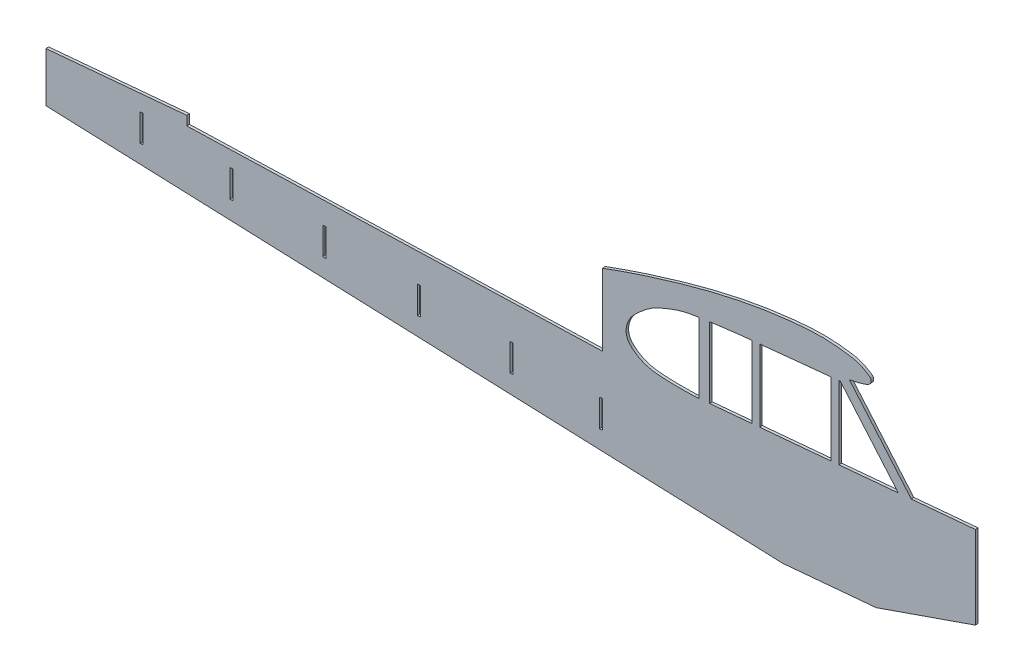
ISO-10303-21;
HEADER;
FILE_DESCRIPTION(('STEP AP214'),'2;1');
FILE_NAME('part.step','',(''),(''),'','','');
FILE_SCHEMA(('AUTOMOTIVE_DESIGN { 1 0 10303 214 1 1 1 1 }'));
ENDSEC;
DATA;
#1=APPLICATION_CONTEXT('core data for automotive mechanical design processes');
#2=APPLICATION_PROTOCOL_DEFINITION('international standard','automotive_design',2000,#1);
#3=PRODUCT_CONTEXT('',#1,'mechanical');
#4=PRODUCT('Part','Part','',(#3));
#5=PRODUCT_RELATED_PRODUCT_CATEGORY('part','',(#4));
#6=PRODUCT_DEFINITION_FORMATION('','',#4);
#7=PRODUCT_DEFINITION_CONTEXT('part definition',#1,'design');
#8=PRODUCT_DEFINITION('design','',#6,#7);
#9=PRODUCT_DEFINITION_SHAPE('','',#8);
#10=(LENGTH_UNIT() NAMED_UNIT(*) SI_UNIT(.MILLI.,.METRE.));
#11=(NAMED_UNIT(*) PLANE_ANGLE_UNIT() SI_UNIT($,.RADIAN.));
#12=(NAMED_UNIT(*) SI_UNIT($,.STERADIAN.) SOLID_ANGLE_UNIT());
#13=UNCERTAINTY_MEASURE_WITH_UNIT(LENGTH_MEASURE(1.E-05),#10,'distance_accuracy_value','');
#14=(GEOMETRIC_REPRESENTATION_CONTEXT(3) GLOBAL_UNCERTAINTY_ASSIGNED_CONTEXT((#13)) GLOBAL_UNIT_ASSIGNED_CONTEXT((#10,
#11,#12)) REPRESENTATION_CONTEXT('',''));
#15=CARTESIAN_POINT('',(0.,0.,0.));
#16=DIRECTION('',(0.,0.,1.));
#17=DIRECTION('',(1.,0.,0.));
#18=AXIS2_PLACEMENT_3D('',#15,#16,#17);
#19=CARTESIAN_POINT('',(-423.149370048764,-154.376097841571,18.1393212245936));
#20=DIRECTION('',(-0.270182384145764,0.962443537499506,0.0265314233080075));
#21=DIRECTION('',(-0.962782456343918,-0.270277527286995,0.));
#22=AXIS2_PLACEMENT_3D('',#19,#20,#21);
#23=PLANE('',#22);
#24=DIRECTION('',(-0.957836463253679,-0.271481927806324,0.09405781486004));
#25=VECTOR('',#24,1.);
#26=CARTESIAN_POINT('',(401.05808342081,79.0371381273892,-55.7626965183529));
#27=LINE('',#26,#25);
#28=CARTESIAN_POINT('',(710.071109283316,166.621454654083,-86.1072188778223));
#29=VERTEX_POINT('',#28);
#30=CARTESIAN_POINT('',(696.065326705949,162.651761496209,-84.7318762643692));
#31=VERTEX_POINT('',#30);
#32=EDGE_CURVE('E791',#29,#31,#27,.T.);
#33=ORIENTED_EDGE('',*,*,#32,.F.);
#34=DIRECTION('',(0.957836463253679,0.271481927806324,-0.09405781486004));
#35=VECTOR('',#34,1.);
#36=CARTESIAN_POINT('',(756.306627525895,179.726100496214,-90.6474634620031));
#37=LINE('',#36,#35);
#38=CARTESIAN_POINT('',(763.086803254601,181.647822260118,-91.3132645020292));
#39=VERTEX_POINT('',#38);
#40=EDGE_CURVE('E789',#29,#39,#37,.T.);
#41=ORIENTED_EDGE('',*,*,#40,.T.);
#42=DIRECTION('',(-0.957836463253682,-0.271481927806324,0.0940578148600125));
#43=VECTOR('',#42,1.);
#44=CARTESIAN_POINT('',(715.851959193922,168.259935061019,-86.6748879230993));
#45=LINE('',#44,#43);
#46=CARTESIAN_POINT('',(795.236279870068,190.760026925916,-94.4702851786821));
#47=VERTEX_POINT('',#46);
#48=EDGE_CURVE('E786',#47,#39,#45,.T.);
#49=ORIENTED_EDGE('',*,*,#48,.F.);
#50=DIRECTION('',(0.0977281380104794,0.,0.995213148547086));
#51=VECTOR('',#50,1.);
#52=CARTESIAN_POINT('',(794.552182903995,190.760026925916,-101.436777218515));
#53=LINE('',#52,#51);
#54=CARTESIAN_POINT('',(795.529464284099,190.760026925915,-91.4846457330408));
#55=VERTEX_POINT('',#54);
#56=EDGE_CURVE('E643',#47,#55,#53,.T.);
#57=ORIENTED_EDGE('',*,*,#56,.T.);
#58=DIRECTION('',(-0.957836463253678,-0.271481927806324,0.0940578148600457));
#59=VECTOR('',#58,1.);
#60=CARTESIAN_POINT('',(-422.172088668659,-154.376097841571,28.0914527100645));
#61=LINE('',#60,#59);
#62=CARTESIAN_POINT('',(696.358511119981,162.651761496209,-81.746236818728));
#63=VERTEX_POINT('',#62);
#64=EDGE_CURVE('E56',#55,#63,#61,.T.);
#65=ORIENTED_EDGE('',*,*,#64,.T.);
#66=DIRECTION('',(0.0977281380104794,0.,0.995213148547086));
#67=VECTOR('',#66,1.);
#68=CARTESIAN_POINT('',(695.381229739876,162.651761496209,-91.6983683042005));
#69=LINE('',#68,#67);
#70=EDGE_CURVE('E645',#31,#63,#69,.T.);
#71=ORIENTED_EDGE('',*,*,#70,.F.);
#72=EDGE_LOOP('',(#33,#41,#49,#57,#65,#71));
#73=FACE_BOUND('',#72,.T.);
#74=ADVANCED_FACE('F33',(#73),#23,.F.);
#75=CARTESIAN_POINT('',(794.552182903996,264.381731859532,-101.436777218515));
#76=DIRECTION('',(-0.995213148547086,0.,0.0977281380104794));
#77=DIRECTION('',(0.0977281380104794,0.,0.995213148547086));
#78=AXIS2_PLACEMENT_3D('',#75,#76,#77);
#79=PLANE('',#78);
#80=DIRECTION('',(0.,-1.,0.));
#81=VECTOR('',#80,1.);
#82=CARTESIAN_POINT('',(795.23627987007,0.,-94.4702851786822));
#83=LINE('',#82,#81);
#84=CARTESIAN_POINT('',(795.23627987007,281.601041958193,-94.4702851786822));
#85=VERTEX_POINT('',#84);
#86=EDGE_CURVE('E794',#85,#47,#83,.T.);
#87=ORIENTED_EDGE('',*,*,#86,.F.);
#88=DIRECTION('',(0.0977281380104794,0.,0.995213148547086));
#89=VECTOR('',#88,1.);
#90=CARTESIAN_POINT('',(794.552182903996,281.601041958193,-101.436777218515));
#91=LINE('',#90,#89);
#92=CARTESIAN_POINT('',(795.529464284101,281.601041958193,-91.484645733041));
#93=VERTEX_POINT('',#92);
#94=EDGE_CURVE('E640',#85,#93,#91,.T.);
#95=ORIENTED_EDGE('',*,*,#94,.T.);
#96=DIRECTION('',(0.,-1.,0.));
#97=VECTOR('',#96,1.);
#98=CARTESIAN_POINT('',(795.529464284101,264.381731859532,-91.4846457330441));
#99=LINE('',#98,#97);
#100=EDGE_CURVE('E463',#93,#55,#99,.T.);
#101=ORIENTED_EDGE('',*,*,#100,.T.);
#102=ORIENTED_EDGE('',*,*,#56,.F.);
#103=EDGE_LOOP('',(#87,#95,#101,#102));
#104=FACE_BOUND('',#103,.T.);
#105=ADVANCED_FACE('F916',(#104),#79,.F.);
#106=CARTESIAN_POINT('',(-540.70534543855,281.601041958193,29.6831061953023));
#107=DIRECTION('',(0.,-1.,0.));
#108=DIRECTION('',(0.,0.,-1.));
#109=AXIS2_PLACEMENT_3D('',#106,#107,#108);
#110=PLANE('',#109);
#111=DIRECTION('',(0.99521314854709,0.,-0.0977281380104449));
#112=VECTOR('',#111,1.);
#113=CARTESIAN_POINT('',(763.086803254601,281.601041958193,-91.3132645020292));
#114=LINE('',#113,#112);
#115=CARTESIAN_POINT('',(763.086803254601,281.601041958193,-91.3132645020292));
#116=VERTEX_POINT('',#115);
#117=EDGE_CURVE('E797',#116,#85,#114,.T.);
#118=ORIENTED_EDGE('',*,*,#117,.F.);
#119=DIRECTION('',(-0.995213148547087,0.,0.0977281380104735));
#120=VECTOR('',#119,1.);
#121=CARTESIAN_POINT('',(736.578956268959,281.601041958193,-88.7102416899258));
#122=LINE('',#121,#120);
#123=CARTESIAN_POINT('',(731.128636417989,281.601041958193,-88.1750301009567));
#124=VERTEX_POINT('',#123);
#125=EDGE_CURVE('E800',#116,#124,#122,.T.);
#126=ORIENTED_EDGE('',*,*,#125,.T.);
#127=DIRECTION('',(0.0977281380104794,0.,0.995213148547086));
#128=VECTOR('',#127,1.);
#129=CARTESIAN_POINT('',(730.444539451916,281.601041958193,-95.1415221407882));
#130=LINE('',#129,#128);
#131=CARTESIAN_POINT('',(731.421820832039,281.601041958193,-85.1893906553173));
#132=VERTEX_POINT('',#131);
#133=EDGE_CURVE('E637',#124,#132,#130,.T.);
#134=ORIENTED_EDGE('',*,*,#133,.T.);
#135=DIRECTION('',(0.99521314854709,0.,-0.0977281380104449));
#136=VECTOR('',#135,1.);
#137=CARTESIAN_POINT('',(763.379987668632,281.601041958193,-88.327625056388));
#138=LINE('',#137,#136);
#139=EDGE_CURVE('E834',#132,#93,#138,.T.);
#140=ORIENTED_EDGE('',*,*,#139,.T.);
#141=ORIENTED_EDGE('',*,*,#94,.F.);
#142=EDGE_LOOP('',(#118,#126,#134,#140,#141));
#143=FACE_BOUND('',#142,.T.);
#144=ADVANCED_FACE('F918',(#143),#110,.F.);
#145=CARTESIAN_POINT('',(422.221834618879,264.381731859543,-64.874607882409));
#146=DIRECTION('',(-0.995213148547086,0.,0.0977281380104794));
#147=DIRECTION('',(0.0977281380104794,0.,0.995213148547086));
#148=AXIS2_PLACEMENT_3D('',#145,#146,#147);
#149=PLANE('',#148);
#150=DIRECTION('',(0.,1.,0.));
#151=VECTOR('',#150,1.);
#152=CARTESIAN_POINT('',(422.905931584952,250.,-57.9081158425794));
#153=LINE('',#152,#151);
#154=CARTESIAN_POINT('',(422.905931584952,282.94314409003,-57.9081158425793));
#155=VERTEX_POINT('',#154);
#156=CARTESIAN_POINT('',(422.905931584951,361.878745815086,-57.9081158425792));
#157=VERTEX_POINT('',#156);
#158=EDGE_CURVE('E556',#155,#157,#153,.T.);
#159=ORIENTED_EDGE('',*,*,#158,.F.);
#160=DIRECTION('',(0.0977281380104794,0.,0.995213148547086));
#161=VECTOR('',#160,1.);
#162=CARTESIAN_POINT('',(422.221834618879,282.94314409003,-64.8746078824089));
#163=LINE('',#162,#161);
#164=CARTESIAN_POINT('',(423.199115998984,282.94314409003,-54.9224763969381));
#165=VERTEX_POINT('',#164);
#166=EDGE_CURVE('E663',#155,#165,#163,.T.);
#167=ORIENTED_EDGE('',*,*,#166,.T.);
#168=DIRECTION('',(0.,-1.,0.));
#169=VECTOR('',#168,1.);
#170=CARTESIAN_POINT('',(423.199115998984,264.381731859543,-54.9224763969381));
#171=LINE('',#170,#169);
#172=CARTESIAN_POINT('',(423.199115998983,361.878745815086,-54.922476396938));
#173=VERTEX_POINT('',#172);
#174=EDGE_CURVE('E447',#173,#165,#171,.T.);
#175=ORIENTED_EDGE('',*,*,#174,.F.);
#176=DIRECTION('',(0.0977281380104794,0.,0.995213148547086));
#177=VECTOR('',#176,1.);
#178=CARTESIAN_POINT('',(422.221834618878,361.878745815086,-64.8746078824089));
#179=LINE('',#178,#177);
#180=EDGE_CURVE('E666',#157,#173,#179,.T.);
#181=ORIENTED_EDGE('',*,*,#180,.F.);
#182=EDGE_LOOP('',(#159,#167,#175,#181));
#183=FACE_BOUND('',#182,.T.);
#184=ADVANCED_FACE('F936',(#183),#149,.T.);
#185=CARTESIAN_POINT('',(-535.564844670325,344.775808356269,29.1783182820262));
#186=DIRECTION('',(-0.0638097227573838,-0.997942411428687,0.00626599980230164));
#187=DIRECTION('',(0.997962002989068,-0.063810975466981,0.));
#188=AXIS2_PLACEMENT_3D('',#185,#186,#187);
#189=PLANE('',#188);
#190=DIRECTION('',(0.993165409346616,-0.0641166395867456,-0.0975270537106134));
#191=VECTOR('',#190,1.);
#192=CARTESIAN_POINT('',(-121.004888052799,318.056865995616,-4.49705337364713));
#193=LINE('',#192,#191);
#194=CARTESIAN_POINT('',(7.70829693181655,309.747417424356,-17.1364562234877));
#195=VERTEX_POINT('',#194);
#196=CARTESIAN_POINT('',(403.908779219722,284.16955971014,-56.0426297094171));
#197=VERTEX_POINT('',#196);
#198=EDGE_CURVE('E694',#195,#197,#193,.T.);
#199=ORIENTED_EDGE('',*,*,#198,.F.);
#200=DIRECTION('',(0.0977281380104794,0.,0.995213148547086));
#201=VECTOR('',#200,1.);
#202=CARTESIAN_POINT('',(7.0241999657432,309.747417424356,-24.1029482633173));
#203=LINE('',#202,#201);
#204=CARTESIAN_POINT('',(8.00148134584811,309.747417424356,-14.1508167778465));
#205=VERTEX_POINT('',#204);
#206=EDGE_CURVE('E660',#195,#205,#203,.T.);
#207=ORIENTED_EDGE('',*,*,#206,.T.);
#208=DIRECTION('',(-0.993165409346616,0.0641166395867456,0.0975270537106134));
#209=VECTOR('',#208,1.);
#210=CARTESIAN_POINT('',(416.006600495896,283.407477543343,-54.2161843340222));
#211=LINE('',#210,#209);
#212=EDGE_CURVE('E830',#165,#205,#211,.T.);
#213=ORIENTED_EDGE('',*,*,#212,.F.);
#214=ORIENTED_EDGE('',*,*,#166,.F.);
#215=DIRECTION('',(-0.993165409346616,0.0641166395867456,0.0975270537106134));
#216=VECTOR('',#215,1.);
#217=CARTESIAN_POINT('',(415.713416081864,283.407477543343,-57.2018237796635));
#218=LINE('',#217,#216);
#219=EDGE_CURVE('E692',#155,#197,#218,.T.);
#220=ORIENTED_EDGE('',*,*,#219,.T.);
#221=EDGE_LOOP('',(#199,#207,#213,#214,#220));
#222=FACE_BOUND('',#221,.T.);
#223=ADVANCED_FACE('F940',(#222),#189,.F.);
#224=CARTESIAN_POINT('',(668.564782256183,367.094954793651,-89.0650414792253));
#225=CARTESIAN_POINT('',(670.66329694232,367.29885427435,-89.2711118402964));
#226=CARTESIAN_POINT('',(675.460661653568,367.828957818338,-89.7422044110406));
#227=CARTESIAN_POINT('',(681.853445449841,369.151206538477,-90.3699642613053));
#228=CARTESIAN_POINT('',(687.117207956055,370.690695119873,-90.8868562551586));
#229=CARTESIAN_POINT('',(690.532632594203,373.424196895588,-91.2222448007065));
#230=CARTESIAN_POINT('',(690.470731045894,377.967755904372,-91.2161661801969));
#231=CARTESIAN_POINT('',(686.070236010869,381.475819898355,-90.7840454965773));
#232=CARTESIAN_POINT('',(677.959450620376,387.77937369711,-89.9875809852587));
#233=CARTESIAN_POINT('',(663.539005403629,391.625328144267,-88.5715192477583));
#234=CARTESIAN_POINT('',(645.827368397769,395.113942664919,-86.8322684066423));
#235=CARTESIAN_POINT('',(628.558602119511,396.439866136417,-85.1365066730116));
#236=CARTESIAN_POINT('',(608.794154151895,396.328081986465,-83.1956734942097));
#237=CARTESIAN_POINT('',(587.284656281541,395.546443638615,-81.0834795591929));
#238=CARTESIAN_POINT('',(564.951497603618,393.453732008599,-78.8904036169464));
#239=CARTESIAN_POINT('',(546.255289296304,390.921539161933,-77.05446964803));
#240=CARTESIAN_POINT('',(525.772379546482,387.607684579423,-75.0430848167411));
#241=CARTESIAN_POINT('',(501.76880778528,382.833660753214,-72.68597731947));
#242=CARTESIAN_POINT('',(474.315892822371,376.410578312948,-69.990150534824));
#243=CARTESIAN_POINT('',(447.744377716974,369.525829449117,-67.3808756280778));
#244=CARTESIAN_POINT('',(431.039937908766,364.520832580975,-65.7405297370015));
#245=CARTESIAN_POINT('',(422.221834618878,361.878745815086,-64.8746078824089));
#246=B_SPLINE_CURVE_WITH_KNOTS('',3,(#224,#225,#226,#227,#228,#229,#230,#231,#232,#233,#234,
#235,#236,#237,#238,#239,#240,#241,#242,#243,#244,#245),.UNSPECIFIED.,.F.,.F.,(4,1,1,1,1,1,1,1,
1,1,1,1,1,1,1,1,1,1,1,4),(0.448966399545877,0.460485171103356,0.475338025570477,
0.484571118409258,0.490413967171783,0.497773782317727,0.505441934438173,0.519813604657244,
0.554266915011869,0.584494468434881,0.619074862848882,0.648495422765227,0.692559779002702,
0.736653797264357,0.77103496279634,0.795656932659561,0.850042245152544,0.904732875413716,
0.949709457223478,1.),.UNSPECIFIED.);
#247=DIRECTION('',(0.0977281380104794,0.,0.995213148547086));
#248=VECTOR('',#247,1.);
#249=SURFACE_OF_LINEAR_EXTRUSION('',#246,#248);
#250=CARTESIAN_POINT('',(669.248879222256,367.094954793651,-82.0985494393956));
#251=CARTESIAN_POINT('',(671.347393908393,367.29885427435,-82.3046198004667));
#252=CARTESIAN_POINT('',(676.144758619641,367.828957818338,-82.7757123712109));
#253=CARTESIAN_POINT('',(682.537542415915,369.151206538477,-83.4034722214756));
#254=CARTESIAN_POINT('',(687.801304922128,370.690695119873,-83.920364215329));
#255=CARTESIAN_POINT('',(691.216729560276,373.424196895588,-84.2557527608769));
#256=CARTESIAN_POINT('',(691.154828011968,377.967755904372,-84.2496741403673));
#257=CARTESIAN_POINT('',(686.754332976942,381.475819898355,-83.8175534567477));
#258=CARTESIAN_POINT('',(678.64354758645,387.77937369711,-83.021088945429));
#259=CARTESIAN_POINT('',(664.223102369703,391.625328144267,-81.6050272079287));
#260=CARTESIAN_POINT('',(646.511465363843,395.113942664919,-79.8657763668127));
#261=CARTESIAN_POINT('',(629.242699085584,396.439866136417,-78.1700146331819));
#262=CARTESIAN_POINT('',(609.478251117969,396.328081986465,-76.22918145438));
#263=CARTESIAN_POINT('',(587.968753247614,395.546443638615,-74.1169875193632));
#264=CARTESIAN_POINT('',(565.635594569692,393.453732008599,-71.9239115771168));
#265=CARTESIAN_POINT('',(546.939386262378,390.921539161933,-70.0879776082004));
#266=CARTESIAN_POINT('',(526.456476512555,387.607684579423,-68.0765927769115));
#267=CARTESIAN_POINT('',(502.452904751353,382.833660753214,-65.7194852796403));
#268=CARTESIAN_POINT('',(474.999989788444,376.410578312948,-63.0236584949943));
#269=CARTESIAN_POINT('',(448.428474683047,369.525829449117,-60.4143835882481));
#270=CARTESIAN_POINT('',(431.72403487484,364.520832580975,-58.7740376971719));
#271=CARTESIAN_POINT('',(422.905931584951,361.878745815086,-57.9081158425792));
#272=B_SPLINE_CURVE_WITH_KNOTS('',3,(#250,#251,#252,#253,#254,#255,#256,#257,#258,#259,#260,
#261,#262,#263,#264,#265,#266,#267,#268,#269,#270,#271),.UNSPECIFIED.,.F.,.F.,(4,1,1,1,1,1,1,1,
1,1,1,1,1,1,1,1,1,1,1,4),(0.448966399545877,0.460485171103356,0.475338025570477,
0.484571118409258,0.490413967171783,0.497773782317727,0.505441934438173,0.519813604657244,
0.554266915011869,0.584494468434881,0.619074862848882,0.648495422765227,0.692559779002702,
0.736653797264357,0.77103496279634,0.795656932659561,0.850042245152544,0.904732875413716,
0.949709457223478,1.),.UNSPECIFIED.);
#273=CARTESIAN_POINT('',(423.245818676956,361.980582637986,-57.941492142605));
#274=VERTEX_POINT('',#273);
#275=CARTESIAN_POINT('',(669.248879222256,367.09495479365,-82.0985494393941));
#276=VERTEX_POINT('',#275);
#277=EDGE_CURVE('E710',#274,#276,#272,.F.);
#278=ORIENTED_EDGE('',*,*,#277,.F.);
#279=CARTESIAN_POINT('',(669.248879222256,367.094954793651,-82.0985494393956));
#280=CARTESIAN_POINT('',(671.347393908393,367.29885427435,-82.3046198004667));
#281=CARTESIAN_POINT('',(676.144758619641,367.828957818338,-82.7757123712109));
#282=CARTESIAN_POINT('',(682.537542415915,369.151206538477,-83.4034722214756));
#283=CARTESIAN_POINT('',(687.801304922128,370.690695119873,-83.920364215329));
#284=CARTESIAN_POINT('',(691.216729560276,373.424196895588,-84.2557527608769));
#285=CARTESIAN_POINT('',(691.154828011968,377.967755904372,-84.2496741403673));
#286=CARTESIAN_POINT('',(686.754332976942,381.475819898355,-83.8175534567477));
#287=CARTESIAN_POINT('',(678.64354758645,387.77937369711,-83.021088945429));
#288=CARTESIAN_POINT('',(664.223102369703,391.625328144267,-81.6050272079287));
#289=CARTESIAN_POINT('',(646.511465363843,395.113942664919,-79.8657763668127));
#290=CARTESIAN_POINT('',(629.242699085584,396.439866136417,-78.1700146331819));
#291=CARTESIAN_POINT('',(609.478251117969,396.328081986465,-76.22918145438));
#292=CARTESIAN_POINT('',(587.968753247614,395.546443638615,-74.1169875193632));
#293=CARTESIAN_POINT('',(565.635594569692,393.453732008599,-71.9239115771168));
#294=CARTESIAN_POINT('',(546.939386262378,390.921539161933,-70.0879776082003));
#295=CARTESIAN_POINT('',(526.456476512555,387.607684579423,-68.0765927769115));
#296=CARTESIAN_POINT('',(502.452904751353,382.833660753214,-65.7194852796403));
#297=CARTESIAN_POINT('',(474.999989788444,376.410578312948,-63.0236584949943));
#298=CARTESIAN_POINT('',(448.428474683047,369.525829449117,-60.4143835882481));
#299=CARTESIAN_POINT('',(431.72403487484,364.520832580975,-58.7740376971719));
#300=CARTESIAN_POINT('',(422.905931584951,361.878745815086,-57.9081158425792));
#301=B_SPLINE_CURVE_WITH_KNOTS('',3,(#279,#280,#281,#282,#283,#284,#285,#286,#287,#288,#289,
#290,#291,#292,#293,#294,#295,#296,#297,#298,#299,#300),.UNSPECIFIED.,.F.,.F.,(4,1,1,1,1,1,1,1,
1,1,1,1,1,1,1,1,1,1,1,4),(0.448966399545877,0.460485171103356,0.475338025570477,
0.484571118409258,0.490413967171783,0.497773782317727,0.505441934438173,0.519813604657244,
0.554266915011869,0.584494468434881,0.619074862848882,0.648495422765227,0.692559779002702,
0.736653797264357,0.77103496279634,0.795656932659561,0.850042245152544,0.904732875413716,
0.949709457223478,1.),.UNSPECIFIED.);
#302=EDGE_CURVE('E705',#274,#157,#301,.T.);
#303=ORIENTED_EDGE('',*,*,#302,.T.);
#304=ORIENTED_EDGE('',*,*,#180,.T.);
#305=CARTESIAN_POINT('',(669.542063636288,367.094954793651,-79.1129099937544));
#306=CARTESIAN_POINT('',(671.640578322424,367.29885427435,-79.3189803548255));
#307=CARTESIAN_POINT('',(676.437943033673,367.828957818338,-79.7900729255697));
#308=CARTESIAN_POINT('',(682.830726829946,369.151206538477,-80.4178327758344));
#309=CARTESIAN_POINT('',(688.094489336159,370.690695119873,-80.9347247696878));
#310=CARTESIAN_POINT('',(691.509913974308,373.424196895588,-81.2701133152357));
#311=CARTESIAN_POINT('',(691.448012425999,377.967755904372,-81.2640346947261));
#312=CARTESIAN_POINT('',(687.047517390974,381.475819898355,-80.8319140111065));
#313=CARTESIAN_POINT('',(678.936732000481,387.77937369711,-80.0354494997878));
#314=CARTESIAN_POINT('',(664.516286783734,391.625328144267,-78.6193877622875));
#315=CARTESIAN_POINT('',(646.804649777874,395.113942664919,-76.8801369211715));
#316=CARTESIAN_POINT('',(629.535883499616,396.439866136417,-75.1843751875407));
#317=CARTESIAN_POINT('',(609.771435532,396.328081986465,-73.2435420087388));
#318=CARTESIAN_POINT('',(588.261937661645,395.546443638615,-71.131348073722));
#319=CARTESIAN_POINT('',(565.928778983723,393.453732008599,-68.9382721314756));
#320=CARTESIAN_POINT('',(547.232570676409,390.921539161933,-67.1023381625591));
#321=CARTESIAN_POINT('',(526.749660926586,387.607684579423,-65.0909533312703));
#322=CARTESIAN_POINT('',(502.746089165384,382.833660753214,-62.7338458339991));
#323=CARTESIAN_POINT('',(475.293174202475,376.410578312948,-60.0380190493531));
#324=CARTESIAN_POINT('',(448.721659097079,369.525829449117,-57.4287441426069));
#325=CARTESIAN_POINT('',(432.017219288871,364.520832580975,-55.7883982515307));
#326=CARTESIAN_POINT('',(423.199115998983,361.878745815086,-54.922476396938));
#327=B_SPLINE_CURVE_WITH_KNOTS('',3,(#305,#306,#307,#308,#309,#310,#311,#312,#313,#314,#315,
#316,#317,#318,#319,#320,#321,#322,#323,#324,#325,#326),.UNSPECIFIED.,.F.,.F.,(4,1,1,1,1,1,1,1,
1,1,1,1,1,1,1,1,1,1,1,4),(0.448966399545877,0.460485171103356,0.475338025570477,
0.484571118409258,0.490413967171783,0.497773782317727,0.505441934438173,0.519813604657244,
0.554266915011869,0.584494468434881,0.619074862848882,0.648495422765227,0.692559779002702,
0.736653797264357,0.77103496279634,0.795656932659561,0.850042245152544,0.904732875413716,
0.949709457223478,1.),.UNSPECIFIED.);
#328=CARTESIAN_POINT('',(669.542063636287,367.094954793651,-79.1129099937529));
#329=VERTEX_POINT('',#328);
#330=EDGE_CURVE('E443',#173,#329,#327,.F.);
#331=ORIENTED_EDGE('',*,*,#330,.T.);
#332=DIRECTION('',(0.0977281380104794,0.,0.995213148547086));
#333=VECTOR('',#332,1.);
#334=CARTESIAN_POINT('',(668.564782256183,367.094954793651,-89.0650414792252));
#335=LINE('',#334,#333);
#336=EDGE_CURVE('E634',#276,#329,#335,.T.);
#337=ORIENTED_EDGE('',*,*,#336,.F.);
#338=EDGE_LOOP('',(#278,#303,#304,#331,#337));
#339=FACE_BOUND('',#338,.T.);
#340=ADVANCED_FACE('F926',(#339),#249,.T.);
#341=CARTESIAN_POINT('',(7.02419996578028,264.381731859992,-24.102948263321));
#342=DIRECTION('',(0.995213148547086,8.34897363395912E-13,-0.0977281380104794));
#343=DIRECTION('',(-0.0977281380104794,0.,-0.995213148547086));
#344=AXIS2_PLACEMENT_3D('',#341,#342,#343);
#345=PLANE('',#344);
#346=ORIENTED_EDGE('',*,*,#206,.F.);
#347=DIRECTION('',(-8.30900833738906E-13,1.,0.));
#348=VECTOR('',#347,1.);
#349=CARTESIAN_POINT('',(7.70829693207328,1.25040126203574E-10,-17.1364562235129));
#350=LINE('',#349,#348);
#351=CARTESIAN_POINT('',(7.70829693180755,319.854198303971,-17.1364562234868));
#352=VERTEX_POINT('',#351);
#353=EDGE_CURVE('E744',#195,#352,#350,.T.);
#354=ORIENTED_EDGE('',*,*,#353,.T.);
#355=DIRECTION('',(0.0977281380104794,0.,0.995213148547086));
#356=VECTOR('',#355,1.);
#357=CARTESIAN_POINT('',(7.02419996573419,319.854198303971,-24.1029482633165));
#358=LINE('',#357,#356);
#359=CARTESIAN_POINT('',(8.00148134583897,319.854198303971,-14.1508167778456));
#360=VERTEX_POINT('',#359);
#361=EDGE_CURVE('E657',#352,#360,#358,.T.);
#362=ORIENTED_EDGE('',*,*,#361,.T.);
#363=DIRECTION('',(-8.30902189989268E-13,1.,0.));
#364=VECTOR('',#363,1.);
#365=CARTESIAN_POINT('',(8.00148134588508,264.381731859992,-14.1508167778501));
#366=LINE('',#365,#364);
#367=EDGE_CURVE('E452',#205,#360,#366,.T.);
#368=ORIENTED_EDGE('',*,*,#367,.F.);
#369=EDGE_LOOP('',(#346,#354,#362,#368));
#370=FACE_BOUND('',#369,.T.);
#371=ADVANCED_FACE('F945',(#370),#345,.T.);
#372=CARTESIAN_POINT('',(-540.70534543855,319.854198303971,29.6831061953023));
#373=DIRECTION('',(0.,1.,0.));
#374=DIRECTION('',(0.,0.,1.));
#375=AXIS2_PLACEMENT_3D('',#372,#373,#374);
#376=PLANE('',#375);
#377=ORIENTED_EDGE('',*,*,#361,.F.);
#378=DIRECTION('',(-0.995213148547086,0.,0.0977281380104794));
#379=VECTOR('',#378,1.);
#380=CARTESIAN_POINT('',(-141.341853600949,319.854198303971,-2.5));
#381=LINE('',#380,#379);
#382=CARTESIAN_POINT('',(-132.927184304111,319.854198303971,-3.3263053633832));
#383=VERTEX_POINT('',#382);
#384=EDGE_CURVE('E746',#352,#383,#381,.T.);
#385=ORIENTED_EDGE('',*,*,#384,.T.);
#386=DIRECTION('',(0.0977281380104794,0.,0.995213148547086));
#387=VECTOR('',#386,1.);
#388=CARTESIAN_POINT('',(-133.611281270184,319.854198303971,-10.2927974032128));
#389=LINE('',#388,#387);
#390=CARTESIAN_POINT('',(-132.633999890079,319.854198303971,-0.34066591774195));
#391=VERTEX_POINT('',#390);
#392=EDGE_CURVE('E654',#383,#391,#389,.T.);
#393=ORIENTED_EDGE('',*,*,#392,.T.);
#394=DIRECTION('',(-0.995213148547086,0.,0.0977281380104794));
#395=VECTOR('',#394,1.);
#396=CARTESIAN_POINT('',(-539.728064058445,319.854198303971,39.6352376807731));
#397=LINE('',#396,#395);
#398=EDGE_CURVE('E454',#360,#391,#397,.T.);
#399=ORIENTED_EDGE('',*,*,#398,.F.);
#400=EDGE_LOOP('',(#377,#385,#393,#399));
#401=FACE_BOUND('',#400,.T.);
#402=ADVANCED_FACE('F951',(#401),#376,.T.);
#403=CARTESIAN_POINT('',(-532.824382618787,321.305075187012,28.9092098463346));
#404=DIRECTION('',(0.137128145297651,0.990461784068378,-0.0134657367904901));
#405=DIRECTION('',(-0.990551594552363,0.137140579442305,0.));
#406=AXIS2_PLACEMENT_3D('',#403,#404,#405);
#407=PLANE('',#406);
#408=DIRECTION('',(-0.985720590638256,0.137787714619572,0.0967959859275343));
#409=VECTOR('',#408,1.);
#410=CARTESIAN_POINT('',(448.747094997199,184.192964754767,-60.445671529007));
#411=LINE('',#410,#409);
#412=CARTESIAN_POINT('',(602.85087455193,162.651761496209,-75.5783850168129));
#413=VERTEX_POINT('',#412);
#414=CARTESIAN_POINT('',(423.24581868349,187.757628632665,-57.9414921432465));
#415=VERTEX_POINT('',#414);
#416=EDGE_CURVE('E702',#413,#415,#411,.T.);
#417=ORIENTED_EDGE('',*,*,#416,.F.);
#418=DIRECTION('',(0.0977281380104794,0.,0.995213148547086));
#419=VECTOR('',#418,1.);
#420=CARTESIAN_POINT('',(602.166777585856,162.651761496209,-82.5448770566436));
#421=LINE('',#420,#419);
#422=CARTESIAN_POINT('',(603.144058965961,162.651761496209,-72.5927455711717));
#423=VERTEX_POINT('',#422);
#424=EDGE_CURVE('E648',#413,#423,#421,.T.);
#425=ORIENTED_EDGE('',*,*,#424,.T.);
#426=DIRECTION('',(0.985720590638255,-0.137787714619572,-0.0967959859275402));
#427=VECTOR('',#426,1.);
#428=CARTESIAN_POINT('',(405.600274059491,190.265171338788,-53.194301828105));
#429=LINE('',#428,#427);
#430=CARTESIAN_POINT('',(-132.633999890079,265.501573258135,-0.340665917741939));
#431=VERTEX_POINT('',#430);
#432=EDGE_CURVE('E832',#431,#423,#429,.T.);
#433=ORIENTED_EDGE('',*,*,#432,.F.);
#434=DIRECTION('',(0.0977281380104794,0.,0.995213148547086));
#435=VECTOR('',#434,1.);
#436=CARTESIAN_POINT('',(-133.611281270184,265.501573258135,-10.2927974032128));
#437=LINE('',#436,#435);
#438=CARTESIAN_POINT('',(-132.927184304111,265.501573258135,-3.3263053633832));
#439=VERTEX_POINT('',#438);
#440=EDGE_CURVE('E651',#439,#431,#437,.T.);
#441=ORIENTED_EDGE('',*,*,#440,.F.);
#442=DIRECTION('',(-0.985720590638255,0.137787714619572,0.0967959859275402));
#443=VECTOR('',#442,1.);
#444=CARTESIAN_POINT('',(-105.121623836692,261.614807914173,-6.05676130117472));
#445=LINE('',#444,#443);
#446=CARTESIAN_POINT('',(403.908779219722,190.460632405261,-56.0426297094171));
#447=VERTEX_POINT('',#446);
#448=EDGE_CURVE('E699',#447,#439,#445,.T.);
#449=ORIENTED_EDGE('',*,*,#448,.F.);
#450=DIRECTION('',(0.985720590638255,-0.137787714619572,-0.0967959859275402));
#451=VECTOR('',#450,1.);
#452=CARTESIAN_POINT('',(405.307089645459,190.265171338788,-56.1799412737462));
#453=LINE('',#452,#451);
#454=EDGE_CURVE('E697',#447,#415,#453,.T.);
#455=ORIENTED_EDGE('',*,*,#454,.T.);
#456=EDGE_LOOP('',(#417,#425,#433,#441,#449,#455));
#457=FACE_BOUND('',#456,.T.);
#458=ADVANCED_FACE('F957',(#457),#407,.F.);
#459=CARTESIAN_POINT('',(-133.611281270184,264.381731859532,-10.2927974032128));
#460=DIRECTION('',(0.995213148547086,0.,-0.0977281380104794));
#461=DIRECTION('',(-0.0977281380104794,0.,-0.995213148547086));
#462=AXIS2_PLACEMENT_3D('',#459,#460,#461);
#463=PLANE('',#462);
#464=DIRECTION('',(0.,1.,0.));
#465=VECTOR('',#464,1.);
#466=CARTESIAN_POINT('',(-132.927184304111,0.,-3.3263053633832));
#467=LINE('',#466,#465);
#468=EDGE_CURVE('E748',#439,#383,#467,.T.);
#469=ORIENTED_EDGE('',*,*,#468,.F.);
#470=ORIENTED_EDGE('',*,*,#440,.T.);
#471=DIRECTION('',(0.,1.,0.));
#472=VECTOR('',#471,1.);
#473=CARTESIAN_POINT('',(-132.633999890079,264.381731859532,-0.340665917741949));
#474=LINE('',#473,#472);
#475=EDGE_CURVE('E456',#431,#391,#474,.T.);
#476=ORIENTED_EDGE('',*,*,#475,.T.);
#477=ORIENTED_EDGE('',*,*,#392,.F.);
#478=EDGE_LOOP('',(#469,#470,#476,#477));
#479=FACE_BOUND('',#478,.T.);
#480=ADVANCED_FACE('F954',(#479),#463,.F.);
#481=CARTESIAN_POINT('',(298.846989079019,877.902078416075,-52.7594203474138));
#482=DIRECTION('',(-0.804864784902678,-0.588171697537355,0.0790362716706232));
#483=DIRECTION('',(0.590017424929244,-0.807390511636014,0.));
#484=AXIS2_PLACEMENT_3D('',#481,#482,#483);
#485=PLANE('',#484);
#486=DIRECTION('',(0.585356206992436,-0.808736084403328,-0.0574809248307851));
#487=VECTOR('',#486,1.);
#488=CARTESIAN_POINT('',(757.92738731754,244.575523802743,-90.8066191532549));
#489=LINE('',#488,#487);
#490=CARTESIAN_POINT('',(710.071109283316,310.694407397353,-86.1072188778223));
#491=VERTEX_POINT('',#490);
#492=EDGE_CURVE('E804',#276,#491,#489,.T.);
#493=ORIENTED_EDGE('',*,*,#492,.F.);
#494=ORIENTED_EDGE('',*,*,#336,.T.);
#495=DIRECTION('',(-0.585356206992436,0.808736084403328,0.0574809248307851));
#496=VECTOR('',#495,1.);
#497=CARTESIAN_POINT('',(748.267228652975,258.327197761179,-86.843579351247));
#498=LINE('',#497,#496);
#499=EDGE_CURVE('E48',#132,#329,#498,.T.);
#500=ORIENTED_EDGE('',*,*,#499,.F.);
#501=ORIENTED_EDGE('',*,*,#133,.F.);
#502=DIRECTION('',(-0.585356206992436,0.808736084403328,0.0574809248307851));
#503=VECTOR('',#502,1.);
#504=CARTESIAN_POINT('',(747.974044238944,258.327197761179,-89.8292187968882));
#505=LINE('',#504,#503);
#506=EDGE_CURVE('E802',#124,#491,#505,.T.);
#507=ORIENTED_EDGE('',*,*,#506,.T.);
#508=EDGE_LOOP('',(#493,#494,#500,#501,#507));
#509=FACE_BOUND('',#508,.T.);
#510=ADVANCED_FACE('F922',(#509),#485,.F.);
#511=CARTESIAN_POINT('',(-540.70534543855,162.651761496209,29.6831061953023));
#512=DIRECTION('',(0.,1.,0.));
#513=DIRECTION('',(0.,0.,1.));
#514=AXIS2_PLACEMENT_3D('',#511,#512,#513);
#515=PLANE('',#514);
#516=DIRECTION('',(-0.995213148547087,0.,0.0977281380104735));
#517=VECTOR('',#516,1.);
#518=CARTESIAN_POINT('',(423.24581868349,162.651761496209,-57.9414921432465));
#519=LINE('',#518,#517);
#520=EDGE_CURVE('E11',#31,#413,#519,.T.);
#521=ORIENTED_EDGE('',*,*,#520,.F.);
#522=ORIENTED_EDGE('',*,*,#70,.T.);
#523=DIRECTION('',(-0.995213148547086,0.,0.0977281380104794));
#524=VECTOR('',#523,1.);
#525=CARTESIAN_POINT('',(-539.728064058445,162.651761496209,39.6352376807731));
#526=LINE('',#525,#524);
#527=EDGE_CURVE('E459',#63,#423,#526,.T.);
#528=ORIENTED_EDGE('',*,*,#527,.T.);
#529=ORIENTED_EDGE('',*,*,#424,.F.);
#530=EDGE_LOOP('',(#521,#522,#528,#529));
#531=FACE_BOUND('',#530,.T.);
#532=ADVANCED_FACE('F981',(#531),#515,.F.);
#533=CARTESIAN_POINT('',(413.870483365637,250.,-54.0064214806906));
#534=DIRECTION('',(-0.0977281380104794,0.,-0.995213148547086));
#535=DIRECTION('',(-0.995213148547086,0.,0.0977281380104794));
#536=AXIS2_PLACEMENT_3D('',#533,#534,#535);
#537=PLANE('',#536);
#538=ORIENTED_EDGE('',*,*,#499,.T.);
#539=ORIENTED_EDGE('',*,*,#330,.F.);
#540=ORIENTED_EDGE('',*,*,#174,.T.);
#541=ORIENTED_EDGE('',*,*,#212,.T.);
#542=ORIENTED_EDGE('',*,*,#367,.T.);
#543=ORIENTED_EDGE('',*,*,#398,.T.);
#544=ORIENTED_EDGE('',*,*,#475,.F.);
#545=ORIENTED_EDGE('',*,*,#432,.T.);
#546=ORIENTED_EDGE('',*,*,#527,.F.);
#547=ORIENTED_EDGE('',*,*,#64,.F.);
#548=ORIENTED_EDGE('',*,*,#100,.F.);
#549=ORIENTED_EDGE('',*,*,#139,.F.);
#550=EDGE_LOOP('',(#538,#539,#540,#541,#542,#543,#544,#545,#546,#547,#548,#549));
#551=FACE_BOUND('',#550,.T.);
#552=DIRECTION('',(0.995213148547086,0.,-0.0977281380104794));
#553=VECTOR('',#552,1.);
#554=CARTESIAN_POINT('',(-539.728064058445,207.997740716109,39.6352376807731));
#555=LINE('',#554,#553);
#556=CARTESIAN_POINT('',(420.213476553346,207.997740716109,-54.629291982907));
#557=VERTEX_POINT('',#556);
#558=CARTESIAN_POINT('',(423.199115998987,207.997740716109,-54.9224763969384));
#559=VERTEX_POINT('',#558);
#560=EDGE_CURVE('E473',#557,#559,#555,.T.);
#561=ORIENTED_EDGE('',*,*,#560,.F.);
#562=DIRECTION('',(0.,-1.,0.));
#563=VECTOR('',#562,1.);
#564=CARTESIAN_POINT('',(420.213476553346,264.381731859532,-54.629291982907));
#565=LINE('',#564,#563);
#566=CARTESIAN_POINT('',(420.213476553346,237.99774071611,-54.629291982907));
#567=VERTEX_POINT('',#566);
#568=EDGE_CURVE('E466',#567,#557,#565,.T.);
#569=ORIENTED_EDGE('',*,*,#568,.F.);
#570=DIRECTION('',(0.995213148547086,0.,-0.0977281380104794));
#571=VECTOR('',#570,1.);
#572=CARTESIAN_POINT('',(-539.728064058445,237.99774071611,39.6352376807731));
#573=LINE('',#572,#571);
#574=CARTESIAN_POINT('',(423.199115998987,237.99774071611,-54.9224763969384));
#575=VERTEX_POINT('',#574);
#576=EDGE_CURVE('E469',#567,#575,#573,.T.);
#577=ORIENTED_EDGE('',*,*,#576,.T.);
#578=DIRECTION('',(0.,-1.,0.));
#579=VECTOR('',#578,1.);
#580=CARTESIAN_POINT('',(423.199115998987,264.381731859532,-54.9224763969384));
#581=LINE('',#580,#579);
#582=EDGE_CURVE('E471',#575,#559,#581,.T.);
#583=ORIENTED_EDGE('',*,*,#582,.T.);
#584=EDGE_LOOP('',(#561,#569,#577,#583));
#585=FACE_BOUND('',#584,.T.);
#586=DIRECTION('',(-0.995143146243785,-0.0118605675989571,0.0977212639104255));
#587=VECTOR('',#586,1.);
#588=CARTESIAN_POINT('',(-540.706422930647,347.261029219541,39.7313107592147));
#589=LINE('',#588,#587);
#590=CARTESIAN_POINT('',(660.513458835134,361.577712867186,-78.2263172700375));
#591=VERTEX_POINT('',#590);
#592=CARTESIAN_POINT('',(659.332978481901,361.56364336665,-78.1103962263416));
#593=VERTEX_POINT('',#592);
#594=EDGE_CURVE('E490',#591,#593,#589,.T.);
#595=ORIENTED_EDGE('',*,*,#594,.F.);
#596=DIRECTION('',(-0.585356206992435,0.808736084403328,0.0574809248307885));
#597=VECTOR('',#596,1.);
#598=CARTESIAN_POINT('',(291.307219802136,871.678066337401,-41.9709298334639));
#599=LINE('',#598,#597);
#600=CARTESIAN_POINT('',(718.399883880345,281.601041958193,-83.9106599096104));
#601=VERTEX_POINT('',#600);
#602=EDGE_CURVE('E493',#601,#591,#599,.T.);
#603=ORIENTED_EDGE('',*,*,#602,.F.);
#604=DIRECTION('',(-0.995213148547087,0.,0.0977281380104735));
#605=VECTOR('',#604,1.);
#606=CARTESIAN_POINT('',(736.87214068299,281.601041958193,-85.7246022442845));
#607=LINE('',#606,#605);
#608=CARTESIAN_POINT('',(659.3329784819,281.601041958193,-78.1103962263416));
#609=VERTEX_POINT('',#608);
#610=EDGE_CURVE('E838',#601,#609,#607,.T.);
#611=ORIENTED_EDGE('',*,*,#610,.T.);
#612=DIRECTION('',(0.,1.,0.));
#613=VECTOR('',#612,1.);
#614=CARTESIAN_POINT('',(659.3329784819,264.381731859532,-78.1103962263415));
#615=LINE('',#614,#613);
#616=EDGE_CURVE('E487',#609,#593,#615,.T.);
#617=ORIENTED_EDGE('',*,*,#616,.T.);
#618=EDGE_LOOP('',(#595,#603,#611,#617));
#619=FACE_BOUND('',#618,.T.);
#620=DIRECTION('',(-0.995143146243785,-0.0118605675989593,0.0977212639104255));
#621=VECTOR('',#620,1.);
#622=CARTESIAN_POINT('',(-540.706422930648,347.261029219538,39.7313107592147));
#623=LINE('',#622,#621);
#624=CARTESIAN_POINT('',(651.371273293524,361.468752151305,-77.3285711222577));
#625=VERTEX_POINT('',#624);
#626=CARTESIAN_POINT('',(580.097278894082,360.619276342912,-70.3295932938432));
#627=VERTEX_POINT('',#626);
#628=EDGE_CURVE('E476',#625,#627,#623,.T.);
#629=ORIENTED_EDGE('',*,*,#628,.F.);
#630=DIRECTION('',(0.,1.,0.));
#631=VECTOR('',#630,1.);
#632=CARTESIAN_POINT('',(651.371273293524,264.381731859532,-77.3285711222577));
#633=LINE('',#632,#631);
#634=CARTESIAN_POINT('',(651.371273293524,281.601041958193,-77.3285711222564));
#635=VERTEX_POINT('',#634);
#636=EDGE_CURVE('E479',#635,#625,#633,.T.);
#637=ORIENTED_EDGE('',*,*,#636,.F.);
#638=DIRECTION('',(0.995213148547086,0.,-0.0977281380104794));
#639=VECTOR('',#638,1.);
#640=CARTESIAN_POINT('',(-539.728064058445,281.601041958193,39.6352376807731));
#641=LINE('',#640,#639);
#642=CARTESIAN_POINT('',(580.097278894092,281.601041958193,-70.3295932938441));
#643=VERTEX_POINT('',#642);
#644=EDGE_CURVE('E482',#643,#635,#641,.T.);
#645=ORIENTED_EDGE('',*,*,#644,.F.);
#646=DIRECTION('',(0.,1.,0.));
#647=VECTOR('',#646,1.);
#648=CARTESIAN_POINT('',(580.097278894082,264.381731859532,-70.3295932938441));
#649=LINE('',#648,#647);
#650=EDGE_CURVE('E485',#643,#627,#649,.T.);
#651=ORIENTED_EDGE('',*,*,#650,.T.);
#652=EDGE_LOOP('',(#629,#637,#645,#651));
#653=FACE_BOUND('',#652,.T.);
#654=CARTESIAN_POINT('',(530.022728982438,359.194246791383,-65.412362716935));
#655=CARTESIAN_POINT('',(539.122716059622,359.666972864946,-66.3059650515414));
#656=CARTESIAN_POINT('',(548.206924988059,360.00219076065,-67.1980180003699));
#657=CARTESIAN_POINT('',(557.291133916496,360.337408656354,-68.0900709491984));
#658=B_SPLINE_CURVE_WITH_KNOTS('',3,(#654,#655,#656,#657),.UNSPECIFIED.,.F.,.F.,(4,4),
(0.871069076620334,1.),.UNSPECIFIED.);
#659=CARTESIAN_POINT('',(557.291133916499,360.337408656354,-68.0900709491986));
#660=VERTEX_POINT('',#659);
#661=CARTESIAN_POINT('',(530.022728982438,359.194246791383,-65.4123627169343));
#662=VERTEX_POINT('',#661);
#663=EDGE_CURVE('E392',#660,#662,#658,.F.);
#664=ORIENTED_EDGE('',*,*,#663,.F.);
#665=DIRECTION('',(-0.995134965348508,-0.0125344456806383,0.0977204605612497));
#666=VECTOR('',#665,1.);
#667=CARTESIAN_POINT('',(-540.752608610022,346.506752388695,39.7358461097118));
#668=LINE('',#667,#666);
#669=CARTESIAN_POINT('',(572.135573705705,360.524385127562,-69.5477681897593));
#670=VERTEX_POINT('',#669);
#671=EDGE_CURVE('E397',#670,#660,#668,.T.);
#672=ORIENTED_EDGE('',*,*,#671,.F.);
#673=DIRECTION('',(0.,1.,0.));
#674=VECTOR('',#673,1.);
#675=CARTESIAN_POINT('',(572.135573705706,264.381731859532,-69.5477681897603));
#676=LINE('',#675,#674);
#677=CARTESIAN_POINT('',(572.135573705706,281.601041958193,-69.5477681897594));
#678=VERTEX_POINT('',#677);
#679=EDGE_CURVE('E418',#678,#670,#676,.T.);
#680=ORIENTED_EDGE('',*,*,#679,.F.);
#681=DIRECTION('',(0.995213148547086,0.,-0.0977281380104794));
#682=VECTOR('',#681,1.);
#683=CARTESIAN_POINT('',(-539.728064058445,281.601041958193,39.6352376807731));
#684=LINE('',#683,#682);
#685=CARTESIAN_POINT('',(530.022728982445,281.601041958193,-65.412362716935));
#686=VERTEX_POINT('',#685);
#687=EDGE_CURVE('E420',#686,#678,#684,.T.);
#688=ORIENTED_EDGE('',*,*,#687,.F.);
#689=DIRECTION('',(0.,1.,0.));
#690=VECTOR('',#689,1.);
#691=CARTESIAN_POINT('',(530.022728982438,264.381731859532,-65.4123627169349));
#692=LINE('',#691,#690);
#693=EDGE_CURVE('E400',#686,#662,#692,.T.);
#694=ORIENTED_EDGE('',*,*,#693,.T.);
#695=EDGE_LOOP('',(#664,#672,#680,#688,#694));
#696=FACE_BOUND('',#695,.T.);
#697=CARTESIAN_POINT('',(515.029668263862,281.601041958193,-63.9400711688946));
#698=CARTESIAN_POINT('',(503.849404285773,282.413341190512,-62.8421893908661));
#699=CARTESIAN_POINT('',(487.389636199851,283.609221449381,-61.2258698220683));
#700=CARTESIAN_POINT('',(465.769023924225,288.557863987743,-59.10276465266));
#701=CARTESIAN_POINT('',(454.232042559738,296.732722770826,-57.9698538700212));
#702=CARTESIAN_POINT('',(447.367068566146,305.587599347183,-57.295725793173));
#703=CARTESIAN_POINT('',(446.05745237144,315.305868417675,-57.1671238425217));
#704=CARTESIAN_POINT('',(449.626957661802,327.736804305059,-57.5176428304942));
#705=CARTESIAN_POINT('',(460.575740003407,337.586723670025,-58.592793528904));
#706=CARTESIAN_POINT('',(472.704670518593,347.123802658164,-59.7838326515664));
#707=CARTESIAN_POINT('',(486.445987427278,352.197753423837,-61.1332052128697));
#708=CARTESIAN_POINT('',(502.002082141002,357.267658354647,-62.6607856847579));
#709=CARTESIAN_POINT('',(513.240211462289,358.166258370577,-63.7643497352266));
#710=CARTESIAN_POINT('',(519.383056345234,358.571274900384,-64.3675660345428));
#711=CARTESIAN_POINT('',(519.423006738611,358.573905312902,-64.3714890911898));
#712=B_SPLINE_CURVE_WITH_KNOTS('',3,(#697,#698,#699,#700,#701,#702,#703,#704,#705,#706,#707,
#708,#709,#710,#711),.UNSPECIFIED.,.F.,.F.,(4,1,1,1,1,1,1,1,1,1,1,1,4),(0.,0.158930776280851,
0.233980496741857,0.310002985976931,0.354765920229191,0.387102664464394,0.444605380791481,
0.529079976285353,0.589272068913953,0.662337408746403,0.734154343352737,0.820482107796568,
0.821047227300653),.UNSPECIFIED.);
#713=CARTESIAN_POINT('',(519.423006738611,358.573905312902,-64.3714890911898));
#714=VERTEX_POINT('',#713);
#715=CARTESIAN_POINT('',(515.029668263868,281.601041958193,-63.9400711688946));
#716=VERTEX_POINT('',#715);
#717=EDGE_CURVE('E429',#714,#716,#712,.F.);
#718=ORIENTED_EDGE('',*,*,#717,.F.);
#719=DIRECTION('',(0.,1.,0.));
#720=VECTOR('',#719,1.);
#721=CARTESIAN_POINT('',(519.423006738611,264.381731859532,-64.3714890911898));
#722=LINE('',#721,#720);
#723=CARTESIAN_POINT('',(519.423006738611,281.601041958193,-64.3714890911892));
#724=VERTEX_POINT('',#723);
#725=EDGE_CURVE('E434',#724,#714,#722,.T.);
#726=ORIENTED_EDGE('',*,*,#725,.F.);
#727=DIRECTION('',(0.995213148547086,0.,-0.0977281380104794));
#728=VECTOR('',#727,1.);
#729=CARTESIAN_POINT('',(-539.728064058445,281.601041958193,39.6352376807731));
#730=LINE('',#729,#728);
#731=EDGE_CURVE('E440',#716,#724,#730,.T.);
#732=ORIENTED_EDGE('',*,*,#731,.F.);
#733=EDGE_LOOP('',(#718,#726,#732));
#734=FACE_BOUND('',#733,.T.);
#735=DIRECTION('',(0.,-1.,0.));
#736=VECTOR('',#735,1.);
#737=CARTESIAN_POINT('',(238.089470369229,264.381731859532,-36.7450427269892));
#738=LINE('',#737,#736);
#739=CARTESIAN_POINT('',(238.089470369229,263.455716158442,-36.7450427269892));
#740=VERTEX_POINT('',#739);
#741=CARTESIAN_POINT('',(238.089470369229,233.455716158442,-36.7450427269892));
#742=VERTEX_POINT('',#741);
#743=EDGE_CURVE('E531',#740,#742,#738,.T.);
#744=ORIENTED_EDGE('',*,*,#743,.F.);
#745=DIRECTION('',(0.995213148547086,0.,-0.0977281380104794));
#746=VECTOR('',#745,1.);
#747=CARTESIAN_POINT('',(-539.728064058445,263.455716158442,39.6352376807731));
#748=LINE('',#747,#746);
#749=CARTESIAN_POINT('',(241.07510981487,263.455716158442,-37.0382271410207));
#750=VERTEX_POINT('',#749);
#751=EDGE_CURVE('E534',#740,#750,#748,.T.);
#752=ORIENTED_EDGE('',*,*,#751,.T.);
#753=DIRECTION('',(0.,-1.,0.));
#754=VECTOR('',#753,1.);
#755=CARTESIAN_POINT('',(241.07510981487,264.381731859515,-37.0382271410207));
#756=LINE('',#755,#754);
#757=CARTESIAN_POINT('',(241.075109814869,233.455716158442,-37.0382271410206));
#758=VERTEX_POINT('',#757);
#759=EDGE_CURVE('E537',#750,#758,#756,.T.);
#760=ORIENTED_EDGE('',*,*,#759,.T.);
#761=DIRECTION('',(0.995213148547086,1.29526019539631E-13,-0.0977281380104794));
#762=VECTOR('',#761,1.);
#763=CARTESIAN_POINT('',(-539.728064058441,233.455716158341,39.6352376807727));
#764=LINE('',#763,#762);
#765=EDGE_CURVE('E540',#742,#758,#764,.T.);
#766=ORIENTED_EDGE('',*,*,#765,.F.);
#767=EDGE_LOOP('',(#744,#752,#760,#766));
#768=FACE_BOUND('',#767,.T.);
#769=DIRECTION('',(0.,-1.,0.));
#770=VECTOR('',#769,1.);
#771=CARTESIAN_POINT('',(50.9893984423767,264.381731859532,-18.3721527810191));
#772=LINE('',#771,#770);
#773=CARTESIAN_POINT('',(50.9893984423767,289.609264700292,-18.3721527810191));
#774=VERTEX_POINT('',#773);
#775=CARTESIAN_POINT('',(50.9893984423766,259.609264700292,-18.3721527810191));
#776=VERTEX_POINT('',#775);
#777=EDGE_CURVE('E507',#774,#776,#772,.T.);
#778=ORIENTED_EDGE('',*,*,#777,.F.);
#779=DIRECTION('',(0.995213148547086,0.,-0.0977281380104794));
#780=VECTOR('',#779,1.);
#781=CARTESIAN_POINT('',(-539.728064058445,289.609264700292,39.6352376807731));
#782=LINE('',#781,#780);
#783=CARTESIAN_POINT('',(53.9750378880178,289.609264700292,-18.6653371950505));
#784=VERTEX_POINT('',#783);
#785=EDGE_CURVE('E510',#774,#784,#782,.T.);
#786=ORIENTED_EDGE('',*,*,#785,.T.);
#787=DIRECTION('',(0.,-1.,0.));
#788=VECTOR('',#787,1.);
#789=CARTESIAN_POINT('',(53.9750378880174,264.381731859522,-18.6653371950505));
#790=LINE('',#789,#788);
#791=CARTESIAN_POINT('',(53.9750378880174,259.609264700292,-18.6653371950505));
#792=VERTEX_POINT('',#791);
#793=EDGE_CURVE('E513',#784,#792,#790,.T.);
#794=ORIENTED_EDGE('',*,*,#793,.T.);
#795=DIRECTION('',(0.995213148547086,0.,-0.0977281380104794));
#796=VECTOR('',#795,1.);
#797=CARTESIAN_POINT('',(-539.728064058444,259.60926470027,39.6352376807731));
#798=LINE('',#797,#796);
#799=EDGE_CURVE('E516',#776,#792,#798,.T.);
#800=ORIENTED_EDGE('',*,*,#799,.F.);
#801=EDGE_LOOP('',(#778,#786,#794,#800));
#802=FACE_BOUND('',#801,.T.);
#803=DIRECTION('',(0.,-1.,0.));
#804=VECTOR('',#803,1.);
#805=CARTESIAN_POINT('',(330.644293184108,264.381731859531,-45.8337595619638));
#806=LINE('',#805,#804);
#807=CARTESIAN_POINT('',(330.644293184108,250.518056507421,-45.8337595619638));
#808=VERTEX_POINT('',#807);
#809=CARTESIAN_POINT('',(330.644293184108,220.518056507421,-45.8337595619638));
#810=VERTEX_POINT('',#809);
#811=EDGE_CURVE('E543',#808,#810,#806,.T.);
#812=ORIENTED_EDGE('',*,*,#811,.F.);
#813=DIRECTION('',(0.995213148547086,0.,-0.0977281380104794));
#814=VECTOR('',#813,1.);
#815=CARTESIAN_POINT('',(-539.728064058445,250.518056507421,39.6352376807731));
#816=LINE('',#815,#814);
#817=CARTESIAN_POINT('',(333.629932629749,250.518056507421,-46.1269439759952));
#818=VERTEX_POINT('',#817);
#819=EDGE_CURVE('E546',#808,#818,#816,.T.);
#820=ORIENTED_EDGE('',*,*,#819,.T.);
#821=DIRECTION('',(0.,-1.,0.));
#822=VECTOR('',#821,1.);
#823=CARTESIAN_POINT('',(333.629932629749,264.381731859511,-46.1269439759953));
#824=LINE('',#823,#822);
#825=CARTESIAN_POINT('',(333.629932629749,220.518056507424,-46.1269439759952));
#826=VERTEX_POINT('',#825);
#827=EDGE_CURVE('E549',#818,#826,#824,.T.);
#828=ORIENTED_EDGE('',*,*,#827,.T.);
#829=DIRECTION('',(0.995213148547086,1.1287267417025E-12,-0.0977281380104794));
#830=VECTOR('',#829,1.);
#831=CARTESIAN_POINT('',(-539.728064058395,220.518056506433,39.6352376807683));
#832=LINE('',#831,#830);
#833=EDGE_CURVE('E413',#810,#826,#832,.T.);
#834=ORIENTED_EDGE('',*,*,#833,.F.);
#835=EDGE_LOOP('',(#812,#820,#828,#834));
#836=FACE_BOUND('',#835,.T.);
#837=DIRECTION('',(0.,-1.,0.));
#838=VECTOR('',#837,1.);
#839=CARTESIAN_POINT('',(-38.579784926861,264.381731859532,-9.57662036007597));
#840=LINE('',#839,#838);
#841=CARTESIAN_POINT('',(-38.5797849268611,302.129580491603,-9.57662036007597));
#842=VERTEX_POINT('',#841);
#843=CARTESIAN_POINT('',(-38.5797849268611,272.129580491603,-9.57662036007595));
#844=VERTEX_POINT('',#843);
#845=EDGE_CURVE('E495',#842,#844,#840,.T.);
#846=ORIENTED_EDGE('',*,*,#845,.F.);
#847=DIRECTION('',(0.995213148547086,0.,-0.0977281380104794));
#848=VECTOR('',#847,1.);
#849=CARTESIAN_POINT('',(-539.728064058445,302.129580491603,39.6352376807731));
#850=LINE('',#849,#848);
#851=CARTESIAN_POINT('',(-35.5941454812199,302.129580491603,-9.86980477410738));
#852=VERTEX_POINT('',#851);
#853=EDGE_CURVE('E498',#842,#852,#850,.T.);
#854=ORIENTED_EDGE('',*,*,#853,.T.);
#855=DIRECTION('',(0.,-1.,0.));
#856=VECTOR('',#855,1.);
#857=CARTESIAN_POINT('',(-35.5941454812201,264.38173185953,-9.86980477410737));
#858=LINE('',#857,#856);
#859=CARTESIAN_POINT('',(-35.59414548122,272.129580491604,-9.86980477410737));
#860=VERTEX_POINT('',#859);
#861=EDGE_CURVE('E501',#852,#860,#858,.T.);
#862=ORIENTED_EDGE('',*,*,#861,.T.);
#863=DIRECTION('',(0.995213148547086,3.88578058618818E-13,-0.0977281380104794));
#864=VECTOR('',#863,1.);
#865=CARTESIAN_POINT('',(-539.728064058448,272.129580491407,39.6352376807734));
#866=LINE('',#865,#864);
#867=EDGE_CURVE('E504',#844,#860,#866,.T.);
#868=ORIENTED_EDGE('',*,*,#867,.F.);
#869=EDGE_LOOP('',(#846,#854,#862,#868));
#870=FACE_BOUND('',#869,.T.);
#871=DIRECTION('',(0.,-1.,0.));
#872=VECTOR('',#871,1.);
#873=CARTESIAN_POINT('',(143.727510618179,264.381731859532,-27.4788683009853));
#874=LINE('',#873,#872);
#875=CARTESIAN_POINT('',(143.727510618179,276.64598417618,-27.4788683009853));
#876=VERTEX_POINT('',#875);
#877=CARTESIAN_POINT('',(143.727510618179,246.64598417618,-27.4788683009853));
#878=VERTEX_POINT('',#877);
#879=EDGE_CURVE('E519',#876,#878,#874,.T.);
#880=ORIENTED_EDGE('',*,*,#879,.F.);
#881=DIRECTION('',(0.995213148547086,0.,-0.0977281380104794));
#882=VECTOR('',#881,1.);
#883=CARTESIAN_POINT('',(-539.728064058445,276.64598417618,39.6352376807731));
#884=LINE('',#883,#882);
#885=CARTESIAN_POINT('',(146.71315006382,276.64598417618,-27.7720527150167));
#886=VERTEX_POINT('',#885);
#887=EDGE_CURVE('E522',#876,#886,#884,.T.);
#888=ORIENTED_EDGE('',*,*,#887,.T.);
#889=DIRECTION('',(0.,-1.,0.));
#890=VECTOR('',#889,1.);
#891=CARTESIAN_POINT('',(146.71315006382,264.381731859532,-27.7720527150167));
#892=LINE('',#891,#890);
#893=CARTESIAN_POINT('',(146.71315006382,246.64598417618,-27.7720527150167));
#894=VERTEX_POINT('',#893);
#895=EDGE_CURVE('E525',#886,#894,#892,.T.);
#896=ORIENTED_EDGE('',*,*,#895,.T.);
#897=DIRECTION('',(0.995213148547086,0.,-0.0977281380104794));
#898=VECTOR('',#897,1.);
#899=CARTESIAN_POINT('',(-539.728064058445,246.64598417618,39.6352376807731));
#900=LINE('',#899,#898);
#901=EDGE_CURVE('E528',#878,#894,#900,.T.);
#902=ORIENTED_EDGE('',*,*,#901,.F.);
#903=EDGE_LOOP('',(#880,#888,#896,#902));
#904=FACE_BOUND('',#903,.T.);
#905=ADVANCED_FACE('F394',(#551,#585,#619,#653,#696,#734,#768,#802,#836,#870,#904),#537,.F.);
#906=CARTESIAN_POINT('',(-540.70534543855,237.99774071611,29.6831061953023));
#907=DIRECTION('',(0.,-1.,0.));
#908=DIRECTION('',(0.,0.,-1.));
#909=AXIS2_PLACEMENT_3D('',#906,#907,#908);
#910=PLANE('',#909);
#911=DIRECTION('',(-0.995213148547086,0.,0.0977281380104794));
#912=VECTOR('',#911,1.);
#913=CARTESIAN_POINT('',(413.577298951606,237.99774071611,-56.9920609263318));
#914=LINE('',#913,#912);
#915=CARTESIAN_POINT('',(422.905931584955,237.99774071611,-57.9081158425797));
#916=VERTEX_POINT('',#915);
#917=CARTESIAN_POINT('',(419.920292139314,237.99774071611,-57.6149314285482));
#918=VERTEX_POINT('',#917);
#919=EDGE_CURVE('E689',#916,#918,#914,.T.);
#920=ORIENTED_EDGE('',*,*,#919,.F.);
#921=DIRECTION('',(0.0977281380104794,0.,0.995213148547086));
#922=VECTOR('',#921,1.);
#923=CARTESIAN_POINT('',(422.221834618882,237.99774071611,-64.8746078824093));
#924=LINE('',#923,#922);
#925=EDGE_CURVE('E628',#916,#575,#924,.T.);
#926=ORIENTED_EDGE('',*,*,#925,.T.);
#927=ORIENTED_EDGE('',*,*,#576,.F.);
#928=DIRECTION('',(0.0977281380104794,0.,0.995213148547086));
#929=VECTOR('',#928,1.);
#930=CARTESIAN_POINT('',(419.236195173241,237.99774071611,-64.5814234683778));
#931=LINE('',#930,#929);
#932=EDGE_CURVE('E631',#918,#567,#931,.T.);
#933=ORIENTED_EDGE('',*,*,#932,.F.);
#934=EDGE_LOOP('',(#920,#926,#927,#933));
#935=FACE_BOUND('',#934,.T.);
#936=ADVANCED_FACE('F1041',(#935),#910,.T.);
#937=CARTESIAN_POINT('',(422.221834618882,264.381731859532,-64.8746078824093));
#938=DIRECTION('',(-0.995213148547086,0.,0.0977281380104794));
#939=DIRECTION('',(0.0977281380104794,0.,0.995213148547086));
#940=AXIS2_PLACEMENT_3D('',#937,#938,#939);
#941=PLANE('',#940);
#942=DIRECTION('',(0.,1.,0.));
#943=VECTOR('',#942,1.);
#944=CARTESIAN_POINT('',(422.905931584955,250.,-57.9081158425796));
#945=LINE('',#944,#943);
#946=CARTESIAN_POINT('',(422.905931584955,207.997740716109,-57.9081158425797));
#947=VERTEX_POINT('',#946);
#948=EDGE_CURVE('E718',#947,#916,#945,.T.);
#949=ORIENTED_EDGE('',*,*,#948,.F.);
#950=DIRECTION('',(0.0977281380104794,0.,0.995213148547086));
#951=VECTOR('',#950,1.);
#952=CARTESIAN_POINT('',(422.221834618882,207.997740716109,-64.8746078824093));
#953=LINE('',#952,#951);
#954=EDGE_CURVE('E625',#947,#559,#953,.T.);
#955=ORIENTED_EDGE('',*,*,#954,.T.);
#956=ORIENTED_EDGE('',*,*,#582,.F.);
#957=ORIENTED_EDGE('',*,*,#925,.F.);
#958=EDGE_LOOP('',(#949,#955,#956,#957));
#959=FACE_BOUND('',#958,.T.);
#960=ADVANCED_FACE('F1045',(#959),#941,.T.);
#961=CARTESIAN_POINT('',(-540.70534543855,207.997740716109,29.6831061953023));
#962=DIRECTION('',(0.,-1.,0.));
#963=DIRECTION('',(0.,0.,-1.));
#964=AXIS2_PLACEMENT_3D('',#961,#962,#963);
#965=PLANE('',#964);
#966=ORIENTED_EDGE('',*,*,#954,.F.);
#967=DIRECTION('',(-0.995213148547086,0.,0.0977281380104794));
#968=VECTOR('',#967,1.);
#969=CARTESIAN_POINT('',(413.577298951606,207.997740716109,-56.9920609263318));
#970=LINE('',#969,#968);
#971=CARTESIAN_POINT('',(419.920292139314,207.997740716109,-57.6149314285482));
#972=VERTEX_POINT('',#971);
#973=EDGE_CURVE('E724',#947,#972,#970,.T.);
#974=ORIENTED_EDGE('',*,*,#973,.T.);
#975=DIRECTION('',(0.0977281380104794,0.,0.995213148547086));
#976=VECTOR('',#975,1.);
#977=CARTESIAN_POINT('',(419.236195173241,207.997740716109,-64.5814234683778));
#978=LINE('',#977,#976);
#979=EDGE_CURVE('E622',#972,#557,#978,.T.);
#980=ORIENTED_EDGE('',*,*,#979,.T.);
#981=ORIENTED_EDGE('',*,*,#560,.T.);
#982=EDGE_LOOP('',(#966,#974,#980,#981));
#983=FACE_BOUND('',#982,.T.);
#984=ADVANCED_FACE('F1051',(#983),#965,.F.);
#985=CARTESIAN_POINT('',(419.236195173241,264.381731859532,-64.5814234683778));
#986=DIRECTION('',(-0.995213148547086,0.,0.0977281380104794));
#987=DIRECTION('',(0.0977281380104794,0.,0.995213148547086));
#988=AXIS2_PLACEMENT_3D('',#985,#986,#987);
#989=PLANE('',#988);
#990=ORIENTED_EDGE('',*,*,#979,.F.);
#991=DIRECTION('',(0.,1.,0.));
#992=VECTOR('',#991,1.);
#993=CARTESIAN_POINT('',(419.920292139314,250.,-57.6149314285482));
#994=LINE('',#993,#992);
#995=EDGE_CURVE('E726',#972,#918,#994,.T.);
#996=ORIENTED_EDGE('',*,*,#995,.T.);
#997=ORIENTED_EDGE('',*,*,#932,.T.);
#998=ORIENTED_EDGE('',*,*,#568,.T.);
#999=EDGE_LOOP('',(#990,#996,#997,#998));
#1000=FACE_BOUND('',#999,.T.);
#1001=ADVANCED_FACE('F1056',(#1000),#989,.F.);
#1002=CARTESIAN_POINT('',(423.24581868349,0.,-57.9414921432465));
#1003=DIRECTION('',(0.0977281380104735,0.,0.995213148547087));
#1004=DIRECTION('',(0.995213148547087,0.,-0.0977281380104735));
#1005=AXIS2_PLACEMENT_3D('',#1002,#1003,#1004);
#1006=PLANE('',#1005);
#1007=DIRECTION('',(0.,1.,0.));
#1008=VECTOR('',#1007,1.);
#1009=CARTESIAN_POINT('',(651.078088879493,0.,-80.3142105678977));
#1010=LINE('',#1009,#1008);
#1011=CARTESIAN_POINT('',(651.078088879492,281.601041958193,-80.3142105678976));
#1012=VERTEX_POINT('',#1011);
#1013=CARTESIAN_POINT('',(651.078088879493,361.468752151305,-80.3142105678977));
#1014=VERTEX_POINT('',#1013);
#1015=EDGE_CURVE('E867',#1012,#1014,#1010,.T.);
#1016=ORIENTED_EDGE('',*,*,#1015,.T.);
#1017=DIRECTION('',(-0.995143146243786,-0.0118605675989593,0.0977212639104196));
#1018=VECTOR('',#1017,1.);
#1019=CARTESIAN_POINT('',(419.011466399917,358.70287683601,-57.5256863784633));
#1020=LINE('',#1019,#1018);
#1021=CARTESIAN_POINT('',(579.804094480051,360.619276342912,-73.3152327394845));
#1022=VERTEX_POINT('',#1021);
#1023=EDGE_CURVE('E878',#1014,#1022,#1020,.T.);
#1024=ORIENTED_EDGE('',*,*,#1023,.T.);
#1025=DIRECTION('',(0.,1.,0.));
#1026=VECTOR('',#1025,1.);
#1027=CARTESIAN_POINT('',(579.804094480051,0.,-73.3152327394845));
#1028=LINE('',#1027,#1026);
#1029=CARTESIAN_POINT('',(579.804094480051,281.601041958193,-73.3152327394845));
#1030=VERTEX_POINT('',#1029);
#1031=EDGE_CURVE('E876',#1030,#1022,#1028,.T.);
#1032=ORIENTED_EDGE('',*,*,#1031,.F.);
#1033=DIRECTION('',(0.995213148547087,0.,-0.0977281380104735));
#1034=VECTOR('',#1033,1.);
#1035=CARTESIAN_POINT('',(423.24581868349,281.601041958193,-57.9414921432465));
#1036=LINE('',#1035,#1034);
#1037=EDGE_CURVE('E873',#1030,#1012,#1036,.T.);
#1038=ORIENTED_EDGE('',*,*,#1037,.T.);
#1039=EDGE_LOOP('',(#1016,#1024,#1032,#1038));
#1040=FACE_BOUND('',#1039,.T.);
#1041=DIRECTION('',(-0.995134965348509,-0.0125344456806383,0.0977204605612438));
#1042=VECTOR('',#1041,1.);
#1043=CARTESIAN_POINT('',(418.772176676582,358.596354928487,-57.5021885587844));
#1044=LINE('',#1043,#1042);
#1045=CARTESIAN_POINT('',(571.842389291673,360.524385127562,-72.5334076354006));
#1046=VERTEX_POINT('',#1045);
#1047=CARTESIAN_POINT('',(556.997949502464,360.337408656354,-71.0757103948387));
#1048=VERTEX_POINT('',#1047);
#1049=EDGE_CURVE('E840',#1046,#1048,#1044,.T.);
#1050=ORIENTED_EDGE('',*,*,#1049,.T.);
#1051=CARTESIAN_POINT('',(529.729544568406,359.194246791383,-68.3980021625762));
#1052=CARTESIAN_POINT('',(538.829531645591,359.666972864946,-69.2916044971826));
#1053=CARTESIAN_POINT('',(547.913740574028,360.00219076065,-70.1836574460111));
#1054=CARTESIAN_POINT('',(556.997949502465,360.337408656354,-71.0757103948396));
#1055=B_SPLINE_CURVE_WITH_KNOTS('',3,(#1051,#1052,#1053,#1054),.UNSPECIFIED.,.F.,.F.,(4,4),
(0.871069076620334,1.),.UNSPECIFIED.);
#1056=CARTESIAN_POINT('',(529.729544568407,359.194246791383,-68.3980021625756));
#1057=VERTEX_POINT('',#1056);
#1058=EDGE_CURVE('E409',#1048,#1057,#1055,.F.);
#1059=ORIENTED_EDGE('',*,*,#1058,.T.);
#1060=DIRECTION('',(0.,1.,0.));
#1061=VECTOR('',#1060,1.);
#1062=CARTESIAN_POINT('',(529.729544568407,0.,-68.3980021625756));
#1063=LINE('',#1062,#1061);
#1064=CARTESIAN_POINT('',(529.729544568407,281.601041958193,-68.3980021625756));
#1065=VERTEX_POINT('',#1064);
#1066=EDGE_CURVE('E848',#1065,#1057,#1063,.T.);
#1067=ORIENTED_EDGE('',*,*,#1066,.F.);
#1068=DIRECTION('',(0.995213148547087,0.,-0.0977281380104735));
#1069=VECTOR('',#1068,1.);
#1070=CARTESIAN_POINT('',(423.24581868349,281.601041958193,-57.9414921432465));
#1071=LINE('',#1070,#1069);
#1072=CARTESIAN_POINT('',(571.842389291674,281.601041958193,-72.5334076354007));
#1073=VERTEX_POINT('',#1072);
#1074=EDGE_CURVE('E845',#1065,#1073,#1071,.T.);
#1075=ORIENTED_EDGE('',*,*,#1074,.T.);
#1076=DIRECTION('',(0.,1.,0.));
#1077=VECTOR('',#1076,1.);
#1078=CARTESIAN_POINT('',(571.842389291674,0.,-72.5334076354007));
#1079=LINE('',#1078,#1077);
#1080=EDGE_CURVE('E842',#1073,#1046,#1079,.T.);
#1081=ORIENTED_EDGE('',*,*,#1080,.T.);
#1082=EDGE_LOOP('',(#1050,#1059,#1067,#1075,#1081));
#1083=FACE_BOUND('',#1082,.T.);
#1084=DIRECTION('',(0.,1.,0.));
#1085=VECTOR('',#1084,1.);
#1086=CARTESIAN_POINT('',(519.12982232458,0.,-67.3571285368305));
#1087=LINE('',#1086,#1085);
#1088=CARTESIAN_POINT('',(519.12982232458,281.601041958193,-67.3571285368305));
#1089=VERTEX_POINT('',#1088);
#1090=CARTESIAN_POINT('',(519.12982232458,358.573905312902,-67.3571285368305));
#1091=VERTEX_POINT('',#1090);
#1092=EDGE_CURVE('E853',#1089,#1091,#1087,.T.);
#1093=ORIENTED_EDGE('',*,*,#1092,.T.);
#1094=CARTESIAN_POINT('',(514.736483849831,281.601041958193,-66.9257106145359));
#1095=CARTESIAN_POINT('',(503.556219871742,282.413341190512,-65.8278288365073));
#1096=CARTESIAN_POINT('',(487.09645178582,283.609221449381,-64.2115092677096));
#1097=CARTESIAN_POINT('',(465.475839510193,288.557863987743,-62.0884040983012));
#1098=CARTESIAN_POINT('',(453.938858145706,296.732722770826,-60.9554933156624));
#1099=CARTESIAN_POINT('',(447.073884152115,305.587599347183,-60.2813652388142));
#1100=CARTESIAN_POINT('',(445.764267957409,315.305868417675,-60.1527632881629));
#1101=CARTESIAN_POINT('',(449.333773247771,327.736804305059,-60.5032822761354));
#1102=CARTESIAN_POINT('',(460.282555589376,337.586723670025,-61.5784329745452));
#1103=CARTESIAN_POINT('',(472.411486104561,347.123802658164,-62.7694720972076));
#1104=CARTESIAN_POINT('',(486.152803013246,352.197753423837,-64.1188446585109));
#1105=CARTESIAN_POINT('',(501.708897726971,357.267658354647,-65.6464251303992));
#1106=CARTESIAN_POINT('',(512.947027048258,358.166258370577,-66.7499891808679));
#1107=CARTESIAN_POINT('',(519.089871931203,358.571274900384,-67.3532054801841));
#1108=CARTESIAN_POINT('',(519.12982232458,358.573905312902,-67.357128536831));
#1109=B_SPLINE_CURVE_WITH_KNOTS('',3,(#1094,#1095,#1096,#1097,#1098,#1099,#1100,#1101,#1102,
#1103,#1104,#1105,#1106,#1107,#1108),.UNSPECIFIED.,.F.,.F.,(4,1,1,1,1,1,1,1,1,1,1,1,4),(0.,
0.158930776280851,0.233980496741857,0.310002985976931,0.354765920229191,0.387102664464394,
0.444605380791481,0.529079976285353,0.589272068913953,0.662337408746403,0.734154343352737,
0.820482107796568,0.821047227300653),.UNSPECIFIED.);
#1110=CARTESIAN_POINT('',(514.736483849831,281.601041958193,-66.9257106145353));
#1111=VERTEX_POINT('',#1110);
#1112=EDGE_CURVE('E862',#1091,#1111,#1109,.F.);
#1113=ORIENTED_EDGE('',*,*,#1112,.T.);
#1114=DIRECTION('',(0.995213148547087,0.,-0.0977281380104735));
#1115=VECTOR('',#1114,1.);
#1116=CARTESIAN_POINT('',(423.24581868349,281.601041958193,-57.9414921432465));
#1117=LINE('',#1116,#1115);
#1118=EDGE_CURVE('E859',#1111,#1089,#1117,.T.);
#1119=ORIENTED_EDGE('',*,*,#1118,.T.);
#1120=EDGE_LOOP('',(#1093,#1113,#1119));
#1121=FACE_BOUND('',#1120,.T.);
#1122=DIRECTION('',(0.,1.,0.));
#1123=VECTOR('',#1122,1.);
#1124=CARTESIAN_POINT('',(423.24581868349,0.,-57.9414921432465));
#1125=LINE('',#1124,#1123);
#1126=EDGE_CURVE('E827',#415,#274,#1125,.T.);
#1127=ORIENTED_EDGE('',*,*,#1126,.T.);
#1128=ORIENTED_EDGE('',*,*,#277,.T.);
#1129=ORIENTED_EDGE('',*,*,#492,.T.);
#1130=DIRECTION('',(0.,1.,0.));
#1131=VECTOR('',#1130,1.);
#1132=CARTESIAN_POINT('',(710.071109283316,0.,-86.1072188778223));
#1133=LINE('',#1132,#1131);
#1134=CARTESIAN_POINT('',(710.071109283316,292.703122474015,-86.1072188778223));
#1135=VERTEX_POINT('',#1134);
#1136=EDGE_CURVE('E823',#1135,#491,#1133,.T.);
#1137=ORIENTED_EDGE('',*,*,#1136,.F.);
#1138=DIRECTION('',(-0.585356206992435,0.808736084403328,0.0574809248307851));
#1139=VECTOR('',#1138,1.);
#1140=CARTESIAN_POINT('',(749.410336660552,238.35151172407,-89.9702601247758));
#1141=LINE('',#1140,#1139);
#1142=CARTESIAN_POINT('',(660.220274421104,361.577712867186,-81.2119567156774));
#1143=VERTEX_POINT('',#1142);
#1144=EDGE_CURVE('E810',#1135,#1143,#1141,.T.);
#1145=ORIENTED_EDGE('',*,*,#1144,.T.);
#1146=DIRECTION('',(-0.995143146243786,-0.0118605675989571,0.0977212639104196));
#1147=VECTOR('',#1146,1.);
#1148=CARTESIAN_POINT('',(419.011466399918,358.70287683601,-57.5256863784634));
#1149=LINE('',#1148,#1147);
#1150=CARTESIAN_POINT('',(659.039794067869,361.56364336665,-81.0960356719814));
#1151=VERTEX_POINT('',#1150);
#1152=EDGE_CURVE('E41',#1143,#1151,#1149,.T.);
#1153=ORIENTED_EDGE('',*,*,#1152,.T.);
#1154=DIRECTION('',(0.,1.,0.));
#1155=VECTOR('',#1154,1.);
#1156=CARTESIAN_POINT('',(659.039794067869,0.,-81.0960356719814));
#1157=LINE('',#1156,#1155);
#1158=CARTESIAN_POINT('',(659.039794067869,281.601041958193,-81.0960356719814));
#1159=VERTEX_POINT('',#1158);
#1160=EDGE_CURVE('E881',#1159,#1151,#1157,.T.);
#1161=ORIENTED_EDGE('',*,*,#1160,.F.);
#1162=DIRECTION('',(0.995213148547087,0.,-0.0977281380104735));
#1163=VECTOR('',#1162,1.);
#1164=CARTESIAN_POINT('',(423.24581868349,281.601041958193,-57.9414921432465));
#1165=LINE('',#1164,#1163);
#1166=CARTESIAN_POINT('',(710.071109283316,281.601041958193,-86.1072188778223));
#1167=VERTEX_POINT('',#1166);
#1168=EDGE_CURVE('E815',#1159,#1167,#1165,.T.);
#1169=ORIENTED_EDGE('',*,*,#1168,.T.);
#1170=EDGE_CURVE('E826',#29,#1167,#1133,.T.);
#1171=ORIENTED_EDGE('',*,*,#1170,.F.);
#1172=ORIENTED_EDGE('',*,*,#32,.T.);
#1173=ORIENTED_EDGE('',*,*,#520,.T.);
#1174=ORIENTED_EDGE('',*,*,#416,.T.);
#1175=EDGE_LOOP('',(#1127,#1128,#1129,#1137,#1145,#1153,#1161,#1169,#1171,#1172,#1173,#1174));
#1176=FACE_BOUND('',#1175,.T.);
#1177=ADVANCED_FACE('F35',(#1040,#1083,#1121,#1176),#1006,.F.);
#1178=CARTESIAN_POINT('',(736.578956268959,250.,-88.7102416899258));
#1179=DIRECTION('',(-0.0977281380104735,0.,-0.995213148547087));
#1180=DIRECTION('',(-0.995213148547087,0.,0.0977281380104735));
#1181=AXIS2_PLACEMENT_3D('',#1178,#1179,#1180);
#1182=PLANE('',#1181);
#1183=DIRECTION('',(-0.995213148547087,0.,0.0977281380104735));
#1184=VECTOR('',#1183,1.);
#1185=CARTESIAN_POINT('',(736.578956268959,281.601041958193,-88.7102416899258));
#1186=LINE('',#1185,#1184);
#1187=CARTESIAN_POINT('',(718.106699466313,281.601041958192,-86.8962993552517));
#1188=VERTEX_POINT('',#1187);
#1189=EDGE_CURVE('E812',#1188,#1167,#1186,.T.);
#1190=ORIENTED_EDGE('',*,*,#1189,.F.);
#1191=DIRECTION('',(0.585356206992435,-0.808736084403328,-0.0574809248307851));
#1192=VECTOR('',#1191,1.);
#1193=CARTESIAN_POINT('',(739.456993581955,252.103185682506,-88.9928597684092));
#1194=LINE('',#1193,#1192);
#1195=EDGE_CURVE('E807',#1135,#1188,#1194,.T.);
#1196=ORIENTED_EDGE('',*,*,#1195,.F.);
#1197=ORIENTED_EDGE('',*,*,#1136,.T.);
#1198=ORIENTED_EDGE('',*,*,#506,.F.);
#1199=ORIENTED_EDGE('',*,*,#125,.F.);
#1200=DIRECTION('',(0.,1.,0.));
#1201=VECTOR('',#1200,1.);
#1202=CARTESIAN_POINT('',(763.086803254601,0.,-91.3132645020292));
#1203=LINE('',#1202,#1201);
#1204=EDGE_CURVE('E820',#39,#116,#1203,.T.);
#1205=ORIENTED_EDGE('',*,*,#1204,.F.);
#1206=ORIENTED_EDGE('',*,*,#40,.F.);
#1207=ORIENTED_EDGE('',*,*,#1170,.T.);
#1208=EDGE_LOOP('',(#1190,#1196,#1197,#1198,#1199,#1205,#1206,#1207));
#1209=FACE_BOUND('',#1208,.T.);
#1210=ADVANCED_FACE('F908',(#1209),#1182,.T.);
#1211=CARTESIAN_POINT('',(763.086803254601,0.,-91.3132645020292));
#1212=DIRECTION('',(0.0977281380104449,0.,0.99521314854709));
#1213=DIRECTION('',(0.99521314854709,0.,-0.0977281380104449));
#1214=AXIS2_PLACEMENT_3D('',#1211,#1212,#1213);
#1215=PLANE('',#1214);
#1216=ORIENTED_EDGE('',*,*,#1204,.T.);
#1217=ORIENTED_EDGE('',*,*,#117,.T.);
#1218=ORIENTED_EDGE('',*,*,#86,.T.);
#1219=ORIENTED_EDGE('',*,*,#48,.T.);
#1220=EDGE_LOOP('',(#1216,#1217,#1218,#1219));
#1221=FACE_BOUND('',#1220,.T.);
#1222=ADVANCED_FACE('F913',(#1221),#1215,.F.);
#1223=CARTESIAN_POINT('',(-141.341853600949,0.,-2.5));
#1224=DIRECTION('',(0.0977281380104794,0.,0.995213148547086));
#1225=DIRECTION('',(0.995213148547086,0.,-0.0977281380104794));
#1226=AXIS2_PLACEMENT_3D('',#1223,#1224,#1225);
#1227=PLANE('',#1226);
#1228=DIRECTION('',(0.995213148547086,0.,-0.0977281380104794));
#1229=VECTOR('',#1228,1.);
#1230=CARTESIAN_POINT('',(-141.341853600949,263.455716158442,-2.5));
#1231=LINE('',#1230,#1229);
#1232=CARTESIAN_POINT('',(237.796285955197,263.455716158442,-39.7306821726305));
#1233=VERTEX_POINT('',#1232);
#1234=CARTESIAN_POINT('',(240.781925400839,263.455716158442,-40.0238665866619));
#1235=VERTEX_POINT('',#1234);
#1236=EDGE_CURVE('E741',#1233,#1235,#1231,.T.);
#1237=ORIENTED_EDGE('',*,*,#1236,.F.);
#1238=DIRECTION('',(0.,-1.,0.));
#1239=VECTOR('',#1238,1.);
#1240=CARTESIAN_POINT('',(237.796285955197,0.,-39.7306821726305));
#1241=LINE('',#1240,#1239);
#1242=CARTESIAN_POINT('',(237.796285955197,233.455716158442,-39.7306821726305));
#1243=VERTEX_POINT('',#1242);
#1244=EDGE_CURVE('E777',#1233,#1243,#1241,.T.);
#1245=ORIENTED_EDGE('',*,*,#1244,.T.);
#1246=DIRECTION('',(0.995213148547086,1.29526019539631E-13,-0.0977281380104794));
#1247=VECTOR('',#1246,1.);
#1248=CARTESIAN_POINT('',(-141.341853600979,233.455716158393,-2.49999999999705));
#1249=LINE('',#1248,#1247);
#1250=CARTESIAN_POINT('',(240.781925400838,233.455716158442,-40.0238665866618));
#1251=VERTEX_POINT('',#1250);
#1252=EDGE_CURVE('E775',#1243,#1251,#1249,.T.);
#1253=ORIENTED_EDGE('',*,*,#1252,.T.);
#1254=DIRECTION('',(0.,-1.,0.));
#1255=VECTOR('',#1254,1.);
#1256=CARTESIAN_POINT('',(240.781925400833,-8.56296459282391E-12,-40.0238665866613));
#1257=LINE('',#1256,#1255);
#1258=EDGE_CURVE('E772',#1235,#1251,#1257,.T.);
#1259=ORIENTED_EDGE('',*,*,#1258,.F.);
#1260=EDGE_LOOP('',(#1237,#1245,#1253,#1259));
#1261=FACE_BOUND('',#1260,.T.);
#1262=DIRECTION('',(0.995213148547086,0.,-0.0977281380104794));
#1263=VECTOR('',#1262,1.);
#1264=CARTESIAN_POINT('',(-141.341853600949,289.609264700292,-2.5));
#1265=LINE('',#1264,#1263);
#1266=CARTESIAN_POINT('',(50.6962140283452,289.609264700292,-21.3577922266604));
#1267=VERTEX_POINT('',#1266);
#1268=CARTESIAN_POINT('',(53.6818534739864,289.609264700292,-21.6509766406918));
#1269=VERTEX_POINT('',#1268);
#1270=EDGE_CURVE('E735',#1267,#1269,#1265,.T.);
#1271=ORIENTED_EDGE('',*,*,#1270,.F.);
#1272=DIRECTION('',(0.,-1.,0.));
#1273=VECTOR('',#1272,1.);
#1274=CARTESIAN_POINT('',(50.6962140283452,0.,-21.3577922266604));
#1275=LINE('',#1274,#1273);
#1276=CARTESIAN_POINT('',(50.6962140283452,259.609264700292,-21.3577922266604));
#1277=VERTEX_POINT('',#1276);
#1278=EDGE_CURVE('E763',#1267,#1277,#1275,.T.);
#1279=ORIENTED_EDGE('',*,*,#1278,.T.);
#1280=DIRECTION('',(0.995213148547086,0.,-0.0977281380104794));
#1281=VECTOR('',#1280,1.);
#1282=CARTESIAN_POINT('',(-141.341853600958,259.609264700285,-2.49999999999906));
#1283=LINE('',#1282,#1281);
#1284=CARTESIAN_POINT('',(53.6818534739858,259.609264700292,-21.6509766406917));
#1285=VERTEX_POINT('',#1284);
#1286=EDGE_CURVE('E761',#1277,#1285,#1283,.T.);
#1287=ORIENTED_EDGE('',*,*,#1286,.T.);
#1288=DIRECTION('',(0.,-1.,0.));
#1289=VECTOR('',#1288,1.);
#1290=CARTESIAN_POINT('',(53.6818534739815,-3.27880402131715E-12,-21.6509766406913));
#1291=LINE('',#1290,#1289);
#1292=EDGE_CURVE('E758',#1269,#1285,#1291,.T.);
#1293=ORIENTED_EDGE('',*,*,#1292,.F.);
#1294=EDGE_LOOP('',(#1271,#1279,#1287,#1293));
#1295=FACE_BOUND('',#1294,.T.);
#1296=DIRECTION('',(0.995213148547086,0.,-0.0977281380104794));
#1297=VECTOR('',#1296,1.);
#1298=CARTESIAN_POINT('',(-141.341853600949,250.518056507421,-2.5));
#1299=LINE('',#1298,#1297);
#1300=CARTESIAN_POINT('',(330.351108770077,250.518056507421,-48.8193990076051));
#1301=VERTEX_POINT('',#1300);
#1302=CARTESIAN_POINT('',(333.336748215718,250.518056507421,-49.1125834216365));
#1303=VERTEX_POINT('',#1302);
#1304=EDGE_CURVE('E729',#1301,#1303,#1299,.T.);
#1305=ORIENTED_EDGE('',*,*,#1304,.F.);
#1306=DIRECTION('',(0.,-1.,0.));
#1307=VECTOR('',#1306,1.);
#1308=CARTESIAN_POINT('',(330.351108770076,-8.72807312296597E-13,-48.819399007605));
#1309=LINE('',#1308,#1307);
#1310=CARTESIAN_POINT('',(330.351108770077,220.518056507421,-48.8193990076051));
#1311=VERTEX_POINT('',#1310);
#1312=EDGE_CURVE('E784',#1301,#1311,#1309,.T.);
#1313=ORIENTED_EDGE('',*,*,#1312,.T.);
#1314=DIRECTION('',(0.995213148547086,1.12872674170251E-12,-0.0977281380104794));
#1315=VECTOR('',#1314,1.);
#1316=CARTESIAN_POINT('',(-141.341853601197,220.518056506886,-2.49999999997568));
#1317=LINE('',#1316,#1315);
#1318=CARTESIAN_POINT('',(333.336748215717,220.518056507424,-49.1125834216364));
#1319=VERTEX_POINT('',#1318);
#1320=EDGE_CURVE('E782',#1311,#1319,#1317,.T.);
#1321=ORIENTED_EDGE('',*,*,#1320,.T.);
#1322=DIRECTION('',(0.,-1.,0.));
#1323=VECTOR('',#1322,1.);
#1324=CARTESIAN_POINT('',(333.336748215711,-1.15369086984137E-11,-49.1125834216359));
#1325=LINE('',#1324,#1323);
#1326=EDGE_CURVE('E779',#1303,#1319,#1325,.T.);
#1327=ORIENTED_EDGE('',*,*,#1326,.F.);
#1328=EDGE_LOOP('',(#1305,#1313,#1321,#1327));
#1329=FACE_BOUND('',#1328,.T.);
#1330=DIRECTION('',(0.995213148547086,0.,-0.0977281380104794));
#1331=VECTOR('',#1330,1.);
#1332=CARTESIAN_POINT('',(-141.341853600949,302.129580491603,-2.5));
#1333=LINE('',#1332,#1331);
#1334=CARTESIAN_POINT('',(-38.8729693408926,302.129580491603,-12.5622598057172));
#1335=VERTEX_POINT('',#1334);
#1336=CARTESIAN_POINT('',(-35.8873298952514,302.129580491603,-12.8554442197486));
#1337=VERTEX_POINT('',#1336);
#1338=EDGE_CURVE('E732',#1335,#1337,#1333,.T.);
#1339=ORIENTED_EDGE('',*,*,#1338,.F.);
#1340=DIRECTION('',(0.,-1.,0.));
#1341=VECTOR('',#1340,1.);
#1342=CARTESIAN_POINT('',(-38.8729693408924,0.,-12.5622598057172));
#1343=LINE('',#1342,#1341);
#1344=CARTESIAN_POINT('',(-38.8729693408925,272.129580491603,-12.5622598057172));
#1345=VERTEX_POINT('',#1344);
#1346=EDGE_CURVE('E756',#1335,#1345,#1343,.T.);
#1347=ORIENTED_EDGE('',*,*,#1346,.T.);
#1348=DIRECTION('',(0.995213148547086,3.88578058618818E-13,-0.0977281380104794));
#1349=VECTOR('',#1348,1.);
#1350=CARTESIAN_POINT('',(-141.341853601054,272.129580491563,-2.49999999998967));
#1351=LINE('',#1350,#1349);
#1352=CARTESIAN_POINT('',(-35.8873298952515,272.129580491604,-12.8554442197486));
#1353=VERTEX_POINT('',#1352);
#1354=EDGE_CURVE('E754',#1345,#1353,#1351,.T.);
#1355=ORIENTED_EDGE('',*,*,#1354,.T.);
#1356=DIRECTION('',(0.,-1.,0.));
#1357=VECTOR('',#1356,1.);
#1358=CARTESIAN_POINT('',(-35.8873298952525,-3.70060436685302E-13,-12.8554442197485));
#1359=LINE('',#1358,#1357);
#1360=EDGE_CURVE('E751',#1337,#1353,#1359,.T.);
#1361=ORIENTED_EDGE('',*,*,#1360,.F.);
#1362=EDGE_LOOP('',(#1339,#1347,#1355,#1361));
#1363=FACE_BOUND('',#1362,.T.);
#1364=DIRECTION('',(0.995213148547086,0.,-0.0977281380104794));
#1365=VECTOR('',#1364,1.);
#1366=CARTESIAN_POINT('',(-141.341853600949,276.64598417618,-2.5));
#1367=LINE('',#1366,#1365);
#1368=CARTESIAN_POINT('',(143.434326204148,276.64598417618,-30.4645077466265));
#1369=VERTEX_POINT('',#1368);
#1370=CARTESIAN_POINT('',(146.419965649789,276.64598417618,-30.757692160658));
#1371=VERTEX_POINT('',#1370);
#1372=EDGE_CURVE('E738',#1369,#1371,#1367,.T.);
#1373=ORIENTED_EDGE('',*,*,#1372,.F.);
#1374=DIRECTION('',(0.,-1.,0.));
#1375=VECTOR('',#1374,1.);
#1376=CARTESIAN_POINT('',(143.434326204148,0.,-30.4645077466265));
#1377=LINE('',#1376,#1375);
#1378=CARTESIAN_POINT('',(143.434326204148,246.64598417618,-30.4645077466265));
#1379=VERTEX_POINT('',#1378);
#1380=EDGE_CURVE('E770',#1369,#1379,#1377,.T.);
#1381=ORIENTED_EDGE('',*,*,#1380,.T.);
#1382=DIRECTION('',(0.995213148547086,0.,-0.0977281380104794));
#1383=VECTOR('',#1382,1.);
#1384=CARTESIAN_POINT('',(-141.341853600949,246.64598417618,-2.5));
#1385=LINE('',#1384,#1383);
#1386=CARTESIAN_POINT('',(146.419965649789,246.64598417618,-30.757692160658));
#1387=VERTEX_POINT('',#1386);
#1388=EDGE_CURVE('E768',#1379,#1387,#1385,.T.);
#1389=ORIENTED_EDGE('',*,*,#1388,.T.);
#1390=DIRECTION('',(0.,-1.,0.));
#1391=VECTOR('',#1390,1.);
#1392=CARTESIAN_POINT('',(146.419965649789,0.,-30.757692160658));
#1393=LINE('',#1392,#1391);
#1394=EDGE_CURVE('E765',#1371,#1387,#1393,.T.);
#1395=ORIENTED_EDGE('',*,*,#1394,.F.);
#1396=EDGE_LOOP('',(#1373,#1381,#1389,#1395));
#1397=FACE_BOUND('',#1396,.T.);
#1398=DIRECTION('',(0.,1.,0.));
#1399=VECTOR('',#1398,1.);
#1400=CARTESIAN_POINT('',(403.908779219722,0.,-56.0426297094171));
#1401=LINE('',#1400,#1399);
#1402=EDGE_CURVE('E817',#447,#197,#1401,.T.);
#1403=ORIENTED_EDGE('',*,*,#1402,.F.);
#1404=ORIENTED_EDGE('',*,*,#448,.T.);
#1405=ORIENTED_EDGE('',*,*,#468,.T.);
#1406=ORIENTED_EDGE('',*,*,#384,.F.);
#1407=ORIENTED_EDGE('',*,*,#353,.F.);
#1408=ORIENTED_EDGE('',*,*,#198,.T.);
#1409=EDGE_LOOP('',(#1403,#1404,#1405,#1406,#1407,#1408));
#1410=FACE_BOUND('',#1409,.T.);
#1411=ADVANCED_FACE('F959',(#1261,#1295,#1329,#1363,#1397,#1410),#1227,.F.);
#1412=CARTESIAN_POINT('',(413.577298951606,250.,-56.9920609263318));
#1413=DIRECTION('',(-0.0977281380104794,0.,-0.995213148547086));
#1414=DIRECTION('',(-0.995213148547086,0.,0.0977281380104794));
#1415=AXIS2_PLACEMENT_3D('',#1412,#1413,#1414);
#1416=PLANE('',#1415);
#1417=ORIENTED_EDGE('',*,*,#995,.F.);
#1418=ORIENTED_EDGE('',*,*,#973,.F.);
#1419=ORIENTED_EDGE('',*,*,#948,.T.);
#1420=ORIENTED_EDGE('',*,*,#919,.T.);
#1421=EDGE_LOOP('',(#1417,#1418,#1419,#1420));
#1422=FACE_BOUND('',#1421,.T.);
#1423=ORIENTED_EDGE('',*,*,#454,.F.);
#1424=ORIENTED_EDGE('',*,*,#1402,.T.);
#1425=ORIENTED_EDGE('',*,*,#219,.F.);
#1426=ORIENTED_EDGE('',*,*,#158,.T.);
#1427=ORIENTED_EDGE('',*,*,#302,.F.);
#1428=ORIENTED_EDGE('',*,*,#1126,.F.);
#1429=EDGE_LOOP('',(#1423,#1424,#1425,#1426,#1427,#1428));
#1430=FACE_BOUND('',#1429,.T.);
#1431=ADVANCED_FACE('F931',(#1422,#1430),#1416,.T.);
#1432=CARTESIAN_POINT('',(-540.70534543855,250.518056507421,29.6831061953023));
#1433=DIRECTION('',(0.,-1.,0.));
#1434=DIRECTION('',(0.,0.,-1.));
#1435=AXIS2_PLACEMENT_3D('',#1432,#1433,#1434);
#1436=PLANE('',#1435);
#1437=DIRECTION('',(0.0977281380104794,0.,0.995213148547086));
#1438=VECTOR('',#1437,1.);
#1439=CARTESIAN_POINT('',(329.667011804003,250.518056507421,-55.7858910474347));
#1440=LINE('',#1439,#1438);
#1441=EDGE_CURVE('E562',#1301,#808,#1440,.T.);
#1442=ORIENTED_EDGE('',*,*,#1441,.F.);
#1443=ORIENTED_EDGE('',*,*,#1304,.T.);
#1444=DIRECTION('',(0.0977281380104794,0.,0.995213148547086));
#1445=VECTOR('',#1444,1.);
#1446=CARTESIAN_POINT('',(332.652651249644,250.518056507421,-56.0790754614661));
#1447=LINE('',#1446,#1445);
#1448=EDGE_CURVE('E559',#1303,#818,#1447,.T.);
#1449=ORIENTED_EDGE('',*,*,#1448,.T.);
#1450=ORIENTED_EDGE('',*,*,#819,.F.);
#1451=EDGE_LOOP('',(#1442,#1443,#1449,#1450));
#1452=FACE_BOUND('',#1451,.T.);
#1453=ADVANCED_FACE('F967',(#1452),#1436,.T.);
#1454=CARTESIAN_POINT('',(332.652651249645,264.381731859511,-56.0790754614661));
#1455=DIRECTION('',(-0.995213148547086,0.,0.0977281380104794));
#1456=DIRECTION('',(0.0977281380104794,0.,0.995213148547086));
#1457=AXIS2_PLACEMENT_3D('',#1454,#1455,#1456);
#1458=PLANE('',#1457);
#1459=ORIENTED_EDGE('',*,*,#1448,.F.);
#1460=ORIENTED_EDGE('',*,*,#1326,.T.);
#1461=DIRECTION('',(0.0977281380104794,0.,0.995213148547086));
#1462=VECTOR('',#1461,1.);
#1463=CARTESIAN_POINT('',(332.652651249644,220.518056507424,-56.0790754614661));
#1464=LINE('',#1463,#1462);
#1465=EDGE_CURVE('E557',#1319,#826,#1464,.T.);
#1466=ORIENTED_EDGE('',*,*,#1465,.T.);
#1467=ORIENTED_EDGE('',*,*,#827,.F.);
#1468=EDGE_LOOP('',(#1459,#1460,#1466,#1467));
#1469=FACE_BOUND('',#1468,.T.);
#1470=ADVANCED_FACE('F1178',(#1469),#1458,.T.);
#1471=CARTESIAN_POINT('',(-540.7053454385,220.518056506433,29.6831061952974));
#1472=DIRECTION('',(1.12332369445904E-12,-1.,-1.10308362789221E-13));
#1473=DIRECTION('',(1.,1.12332369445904E-12,0.));
#1474=AXIS2_PLACEMENT_3D('',#1471,#1472,#1473);
#1475=PLANE('',#1474);
#1476=ORIENTED_EDGE('',*,*,#1320,.F.);
#1477=DIRECTION('',(0.0977281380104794,0.,0.995213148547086));
#1478=VECTOR('',#1477,1.);
#1479=CARTESIAN_POINT('',(329.667011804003,220.518056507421,-55.7858910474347));
#1480=LINE('',#1479,#1478);
#1481=EDGE_CURVE('E554',#1311,#810,#1480,.T.);
#1482=ORIENTED_EDGE('',*,*,#1481,.T.);
#1483=ORIENTED_EDGE('',*,*,#833,.T.);
#1484=ORIENTED_EDGE('',*,*,#1465,.F.);
#1485=EDGE_LOOP('',(#1476,#1482,#1483,#1484));
#1486=FACE_BOUND('',#1485,.T.);
#1487=ADVANCED_FACE('F1188',(#1486),#1475,.F.);
#1488=CARTESIAN_POINT('',(329.667011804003,264.381731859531,-55.7858910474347));
#1489=DIRECTION('',(-0.995213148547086,0.,0.0977281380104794));
#1490=DIRECTION('',(0.0977281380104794,0.,0.995213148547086));
#1491=AXIS2_PLACEMENT_3D('',#1488,#1489,#1490);
#1492=PLANE('',#1491);
#1493=ORIENTED_EDGE('',*,*,#1312,.F.);
#1494=ORIENTED_EDGE('',*,*,#1441,.T.);
#1495=ORIENTED_EDGE('',*,*,#811,.T.);
#1496=ORIENTED_EDGE('',*,*,#1481,.F.);
#1497=EDGE_LOOP('',(#1493,#1494,#1495,#1496));
#1498=FACE_BOUND('',#1497,.T.);
#1499=ADVANCED_FACE('F1198',(#1498),#1492,.F.);
#1500=CARTESIAN_POINT('',(-540.70534543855,302.129580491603,29.6831061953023));
#1501=DIRECTION('',(0.,-1.,0.));
#1502=DIRECTION('',(0.,0.,-1.));
#1503=AXIS2_PLACEMENT_3D('',#1500,#1501,#1502);
#1504=PLANE('',#1503);
#1505=DIRECTION('',(0.0977281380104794,0.,0.995213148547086));
#1506=VECTOR('',#1505,1.);
#1507=CARTESIAN_POINT('',(-39.5570663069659,302.129580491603,-19.5287518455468));
#1508=LINE('',#1507,#1506);
#1509=EDGE_CURVE('E598',#1335,#842,#1508,.T.);
#1510=ORIENTED_EDGE('',*,*,#1509,.F.);
#1511=ORIENTED_EDGE('',*,*,#1338,.T.);
#1512=DIRECTION('',(0.0977281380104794,0.,0.995213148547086));
#1513=VECTOR('',#1512,1.);
#1514=CARTESIAN_POINT('',(-36.5714268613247,302.129580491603,-19.8219362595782));
#1515=LINE('',#1514,#1513);
#1516=EDGE_CURVE('E595',#1337,#852,#1515,.T.);
#1517=ORIENTED_EDGE('',*,*,#1516,.T.);
#1518=ORIENTED_EDGE('',*,*,#853,.F.);
#1519=EDGE_LOOP('',(#1510,#1511,#1517,#1518));
#1520=FACE_BOUND('',#1519,.T.);
#1521=ADVANCED_FACE('F1208',(#1520),#1504,.T.);
#1522=CARTESIAN_POINT('',(-36.5714268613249,264.38173185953,-19.8219362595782));
#1523=DIRECTION('',(-0.995213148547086,0.,0.0977281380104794));
#1524=DIRECTION('',(0.0977281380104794,0.,0.995213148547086));
#1525=AXIS2_PLACEMENT_3D('',#1522,#1523,#1524);
#1526=PLANE('',#1525);
#1527=ORIENTED_EDGE('',*,*,#1516,.F.);
#1528=ORIENTED_EDGE('',*,*,#1360,.T.);
#1529=DIRECTION('',(0.0977281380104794,0.,0.995213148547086));
#1530=VECTOR('',#1529,1.);
#1531=CARTESIAN_POINT('',(-36.5714268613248,272.129580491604,-19.8219362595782));
#1532=LINE('',#1531,#1530);
#1533=EDGE_CURVE('E593',#1353,#860,#1532,.T.);
#1534=ORIENTED_EDGE('',*,*,#1533,.T.);
#1535=ORIENTED_EDGE('',*,*,#861,.F.);
#1536=EDGE_LOOP('',(#1527,#1528,#1534,#1535));
#1537=FACE_BOUND('',#1536,.T.);
#1538=ADVANCED_FACE('F1218',(#1537),#1526,.T.);
#1539=CARTESIAN_POINT('',(-540.705345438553,272.129580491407,29.6831061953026));
#1540=DIRECTION('',(3.86717993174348E-13,-1.,0.));
#1541=DIRECTION('',(1.,3.86717993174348E-13,0.));
#1542=AXIS2_PLACEMENT_3D('',#1539,#1540,#1541);
#1543=PLANE('',#1542);
#1544=ORIENTED_EDGE('',*,*,#1354,.F.);
#1545=DIRECTION('',(0.0977281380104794,0.,0.995213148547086));
#1546=VECTOR('',#1545,1.);
#1547=CARTESIAN_POINT('',(-39.5570663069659,272.129580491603,-19.5287518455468));
#1548=LINE('',#1547,#1546);
#1549=EDGE_CURVE('E591',#1345,#844,#1548,.T.);
#1550=ORIENTED_EDGE('',*,*,#1549,.T.);
#1551=ORIENTED_EDGE('',*,*,#867,.T.);
#1552=ORIENTED_EDGE('',*,*,#1533,.F.);
#1553=EDGE_LOOP('',(#1544,#1550,#1551,#1552));
#1554=FACE_BOUND('',#1553,.T.);
#1555=ADVANCED_FACE('F1228',(#1554),#1543,.F.);
#1556=CARTESIAN_POINT('',(-39.5570663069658,264.381731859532,-19.5287518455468));
#1557=DIRECTION('',(-0.995213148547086,0.,0.0977281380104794));
#1558=DIRECTION('',(0.0977281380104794,0.,0.995213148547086));
#1559=AXIS2_PLACEMENT_3D('',#1556,#1557,#1558);
#1560=PLANE('',#1559);
#1561=ORIENTED_EDGE('',*,*,#1346,.F.);
#1562=ORIENTED_EDGE('',*,*,#1509,.T.);
#1563=ORIENTED_EDGE('',*,*,#845,.T.);
#1564=ORIENTED_EDGE('',*,*,#1549,.F.);
#1565=EDGE_LOOP('',(#1561,#1562,#1563,#1564));
#1566=FACE_BOUND('',#1565,.T.);
#1567=ADVANCED_FACE('F1238',(#1566),#1560,.F.);
#1568=CARTESIAN_POINT('',(-540.70534543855,289.609264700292,29.6831061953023));
#1569=DIRECTION('',(0.,-1.,0.));
#1570=DIRECTION('',(0.,0.,-1.));
#1571=AXIS2_PLACEMENT_3D('',#1568,#1569,#1570);
#1572=PLANE('',#1571);
#1573=DIRECTION('',(0.0977281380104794,0.,0.995213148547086));
#1574=VECTOR('',#1573,1.);
#1575=CARTESIAN_POINT('',(50.0121170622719,289.609264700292,-28.32428426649));
#1576=LINE('',#1575,#1574);
#1577=EDGE_CURVE('E589',#1267,#774,#1576,.T.);
#1578=ORIENTED_EDGE('',*,*,#1577,.F.);
#1579=ORIENTED_EDGE('',*,*,#1270,.T.);
#1580=DIRECTION('',(0.0977281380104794,0.,0.995213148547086));
#1581=VECTOR('',#1580,1.);
#1582=CARTESIAN_POINT('',(52.997756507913,289.609264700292,-28.6174686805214));
#1583=LINE('',#1582,#1581);
#1584=EDGE_CURVE('E586',#1269,#784,#1583,.T.);
#1585=ORIENTED_EDGE('',*,*,#1584,.T.);
#1586=ORIENTED_EDGE('',*,*,#785,.F.);
#1587=EDGE_LOOP('',(#1578,#1579,#1585,#1586));
#1588=FACE_BOUND('',#1587,.T.);
#1589=ADVANCED_FACE('F1248',(#1588),#1572,.T.);
#1590=CARTESIAN_POINT('',(52.9977565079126,264.381731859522,-28.6174686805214));
#1591=DIRECTION('',(-0.995213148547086,0.,0.0977281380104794));
#1592=DIRECTION('',(0.0977281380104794,0.,0.995213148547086));
#1593=AXIS2_PLACEMENT_3D('',#1590,#1591,#1592);
#1594=PLANE('',#1593);
#1595=ORIENTED_EDGE('',*,*,#1584,.F.);
#1596=ORIENTED_EDGE('',*,*,#1292,.T.);
#1597=DIRECTION('',(0.0977281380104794,0.,0.995213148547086));
#1598=VECTOR('',#1597,1.);
#1599=CARTESIAN_POINT('',(52.9977565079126,259.609264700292,-28.6174686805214));
#1600=LINE('',#1599,#1598);
#1601=EDGE_CURVE('E584',#1285,#792,#1600,.T.);
#1602=ORIENTED_EDGE('',*,*,#1601,.T.);
#1603=ORIENTED_EDGE('',*,*,#793,.F.);
#1604=EDGE_LOOP('',(#1595,#1596,#1602,#1603));
#1605=FACE_BOUND('',#1604,.T.);
#1606=ADVANCED_FACE('F1258',(#1605),#1594,.T.);
#1607=CARTESIAN_POINT('',(-540.705345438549,259.60926470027,29.6831061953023));
#1608=DIRECTION('',(0.,-1.,0.));
#1609=DIRECTION('',(1.,0.,0.));
#1610=AXIS2_PLACEMENT_3D('',#1607,#1608,#1609);
#1611=PLANE('',#1610);
#1612=ORIENTED_EDGE('',*,*,#1286,.F.);
#1613=DIRECTION('',(0.0977281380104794,0.,0.995213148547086));
#1614=VECTOR('',#1613,1.);
#1615=CARTESIAN_POINT('',(50.0121170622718,259.609264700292,-28.32428426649));
#1616=LINE('',#1615,#1614);
#1617=EDGE_CURVE('E582',#1277,#776,#1616,.T.);
#1618=ORIENTED_EDGE('',*,*,#1617,.T.);
#1619=ORIENTED_EDGE('',*,*,#799,.T.);
#1620=ORIENTED_EDGE('',*,*,#1601,.F.);
#1621=EDGE_LOOP('',(#1612,#1618,#1619,#1620));
#1622=FACE_BOUND('',#1621,.T.);
#1623=ADVANCED_FACE('F1268',(#1622),#1611,.F.);
#1624=CARTESIAN_POINT('',(50.0121170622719,264.381731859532,-28.32428426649));
#1625=DIRECTION('',(-0.995213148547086,0.,0.0977281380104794));
#1626=DIRECTION('',(0.0977281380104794,0.,0.995213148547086));
#1627=AXIS2_PLACEMENT_3D('',#1624,#1625,#1626);
#1628=PLANE('',#1627);
#1629=ORIENTED_EDGE('',*,*,#1278,.F.);
#1630=ORIENTED_EDGE('',*,*,#1577,.T.);
#1631=ORIENTED_EDGE('',*,*,#777,.T.);
#1632=ORIENTED_EDGE('',*,*,#1617,.F.);
#1633=EDGE_LOOP('',(#1629,#1630,#1631,#1632));
#1634=FACE_BOUND('',#1633,.T.);
#1635=ADVANCED_FACE('F1278',(#1634),#1628,.F.);
#1636=CARTESIAN_POINT('',(-540.70534543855,276.64598417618,29.6831061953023));
#1637=DIRECTION('',(0.,-1.,0.));
#1638=DIRECTION('',(0.,0.,-1.));
#1639=AXIS2_PLACEMENT_3D('',#1636,#1637,#1638);
#1640=PLANE('',#1639);
#1641=DIRECTION('',(0.0977281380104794,0.,0.995213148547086));
#1642=VECTOR('',#1641,1.);
#1643=CARTESIAN_POINT('',(142.750229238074,276.64598417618,-37.4309997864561));
#1644=LINE('',#1643,#1642);
#1645=EDGE_CURVE('E580',#1369,#876,#1644,.T.);
#1646=ORIENTED_EDGE('',*,*,#1645,.F.);
#1647=ORIENTED_EDGE('',*,*,#1372,.T.);
#1648=DIRECTION('',(0.0977281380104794,0.,0.995213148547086));
#1649=VECTOR('',#1648,1.);
#1650=CARTESIAN_POINT('',(145.735868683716,276.64598417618,-37.7241842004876));
#1651=LINE('',#1650,#1649);
#1652=EDGE_CURVE('E577',#1371,#886,#1651,.T.);
#1653=ORIENTED_EDGE('',*,*,#1652,.T.);
#1654=ORIENTED_EDGE('',*,*,#887,.F.);
#1655=EDGE_LOOP('',(#1646,#1647,#1653,#1654));
#1656=FACE_BOUND('',#1655,.T.);
#1657=ADVANCED_FACE('F1288',(#1656),#1640,.T.);
#1658=CARTESIAN_POINT('',(145.735868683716,264.381731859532,-37.7241842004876));
#1659=DIRECTION('',(-0.995213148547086,0.,0.0977281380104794));
#1660=DIRECTION('',(0.0977281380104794,0.,0.995213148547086));
#1661=AXIS2_PLACEMENT_3D('',#1658,#1659,#1660);
#1662=PLANE('',#1661);
#1663=ORIENTED_EDGE('',*,*,#1652,.F.);
#1664=ORIENTED_EDGE('',*,*,#1394,.T.);
#1665=DIRECTION('',(0.0977281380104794,0.,0.995213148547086));
#1666=VECTOR('',#1665,1.);
#1667=CARTESIAN_POINT('',(145.735868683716,246.64598417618,-37.7241842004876));
#1668=LINE('',#1667,#1666);
#1669=EDGE_CURVE('E575',#1387,#894,#1668,.T.);
#1670=ORIENTED_EDGE('',*,*,#1669,.T.);
#1671=ORIENTED_EDGE('',*,*,#895,.F.);
#1672=EDGE_LOOP('',(#1663,#1664,#1670,#1671));
#1673=FACE_BOUND('',#1672,.T.);
#1674=ADVANCED_FACE('F1298',(#1673),#1662,.T.);
#1675=CARTESIAN_POINT('',(-540.70534543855,246.64598417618,29.6831061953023));
#1676=DIRECTION('',(0.,-1.,0.));
#1677=DIRECTION('',(0.,0.,-1.));
#1678=AXIS2_PLACEMENT_3D('',#1675,#1676,#1677);
#1679=PLANE('',#1678);
#1680=ORIENTED_EDGE('',*,*,#1388,.F.);
#1681=DIRECTION('',(0.0977281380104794,0.,0.995213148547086));
#1682=VECTOR('',#1681,1.);
#1683=CARTESIAN_POINT('',(142.750229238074,246.64598417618,-37.4309997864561));
#1684=LINE('',#1683,#1682);
#1685=EDGE_CURVE('E573',#1379,#878,#1684,.T.);
#1686=ORIENTED_EDGE('',*,*,#1685,.T.);
#1687=ORIENTED_EDGE('',*,*,#901,.T.);
#1688=ORIENTED_EDGE('',*,*,#1669,.F.);
#1689=EDGE_LOOP('',(#1680,#1686,#1687,#1688));
#1690=FACE_BOUND('',#1689,.T.);
#1691=ADVANCED_FACE('F1308',(#1690),#1679,.F.);
#1692=CARTESIAN_POINT('',(142.750229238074,264.381731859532,-37.4309997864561));
#1693=DIRECTION('',(-0.995213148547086,0.,0.0977281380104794));
#1694=DIRECTION('',(0.0977281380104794,0.,0.995213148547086));
#1695=AXIS2_PLACEMENT_3D('',#1692,#1693,#1694);
#1696=PLANE('',#1695);
#1697=ORIENTED_EDGE('',*,*,#1380,.F.);
#1698=ORIENTED_EDGE('',*,*,#1645,.T.);
#1699=ORIENTED_EDGE('',*,*,#879,.T.);
#1700=ORIENTED_EDGE('',*,*,#1685,.F.);
#1701=EDGE_LOOP('',(#1697,#1698,#1699,#1700));
#1702=FACE_BOUND('',#1701,.T.);
#1703=ADVANCED_FACE('F1318',(#1702),#1696,.F.);
#1704=CARTESIAN_POINT('',(-540.70534543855,263.455716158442,29.6831061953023));
#1705=DIRECTION('',(0.,-1.,0.));
#1706=DIRECTION('',(0.,0.,-1.));
#1707=AXIS2_PLACEMENT_3D('',#1704,#1705,#1706);
#1708=PLANE('',#1707);
#1709=DIRECTION('',(0.0977281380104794,0.,0.995213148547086));
#1710=VECTOR('',#1709,1.);
#1711=CARTESIAN_POINT('',(237.112188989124,263.455716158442,-46.6971742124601));
#1712=LINE('',#1711,#1710);
#1713=EDGE_CURVE('E571',#1233,#740,#1712,.T.);
#1714=ORIENTED_EDGE('',*,*,#1713,.F.);
#1715=ORIENTED_EDGE('',*,*,#1236,.T.);
#1716=DIRECTION('',(0.0977281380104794,0.,0.995213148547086));
#1717=VECTOR('',#1716,1.);
#1718=CARTESIAN_POINT('',(240.097828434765,263.455716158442,-46.9903586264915));
#1719=LINE('',#1718,#1717);
#1720=EDGE_CURVE('E568',#1235,#750,#1719,.T.);
#1721=ORIENTED_EDGE('',*,*,#1720,.T.);
#1722=ORIENTED_EDGE('',*,*,#751,.F.);
#1723=EDGE_LOOP('',(#1714,#1715,#1721,#1722));
#1724=FACE_BOUND('',#1723,.T.);
#1725=ADVANCED_FACE('F1328',(#1724),#1708,.T.);
#1726=CARTESIAN_POINT('',(240.097828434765,264.381731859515,-46.9903586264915));
#1727=DIRECTION('',(-0.995213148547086,0.,0.0977281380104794));
#1728=DIRECTION('',(0.0977281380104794,0.,0.995213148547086));
#1729=AXIS2_PLACEMENT_3D('',#1726,#1727,#1728);
#1730=PLANE('',#1729);
#1731=ORIENTED_EDGE('',*,*,#1720,.F.);
#1732=ORIENTED_EDGE('',*,*,#1258,.T.);
#1733=DIRECTION('',(0.0977281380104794,0.,0.995213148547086));
#1734=VECTOR('',#1733,1.);
#1735=CARTESIAN_POINT('',(240.097828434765,233.455716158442,-46.9903586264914));
#1736=LINE('',#1735,#1734);
#1737=EDGE_CURVE('E566',#1251,#758,#1736,.T.);
#1738=ORIENTED_EDGE('',*,*,#1737,.T.);
#1739=ORIENTED_EDGE('',*,*,#759,.F.);
#1740=EDGE_LOOP('',(#1731,#1732,#1738,#1739));
#1741=FACE_BOUND('',#1740,.T.);
#1742=ADVANCED_FACE('F1338',(#1741),#1730,.T.);
#1743=CARTESIAN_POINT('',(-540.705345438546,233.455716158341,29.6831061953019));
#1744=DIRECTION('',(1.28905997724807E-13,-1.,0.));
#1745=DIRECTION('',(1.,1.28905997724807E-13,0.));
#1746=AXIS2_PLACEMENT_3D('',#1743,#1744,#1745);
#1747=PLANE('',#1746);
#1748=ORIENTED_EDGE('',*,*,#1252,.F.);
#1749=DIRECTION('',(0.0977281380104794,0.,0.995213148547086));
#1750=VECTOR('',#1749,1.);
#1751=CARTESIAN_POINT('',(237.112188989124,233.455716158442,-46.6971742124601));
#1752=LINE('',#1751,#1750);
#1753=EDGE_CURVE('E564',#1243,#742,#1752,.T.);
#1754=ORIENTED_EDGE('',*,*,#1753,.T.);
#1755=ORIENTED_EDGE('',*,*,#765,.T.);
#1756=ORIENTED_EDGE('',*,*,#1737,.F.);
#1757=EDGE_LOOP('',(#1748,#1754,#1755,#1756));
#1758=FACE_BOUND('',#1757,.T.);
#1759=ADVANCED_FACE('F1348',(#1758),#1747,.F.);
#1760=CARTESIAN_POINT('',(237.112188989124,264.381731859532,-46.6971742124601));
#1761=DIRECTION('',(-0.995213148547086,0.,0.0977281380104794));
#1762=DIRECTION('',(0.0977281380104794,0.,0.995213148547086));
#1763=AXIS2_PLACEMENT_3D('',#1760,#1761,#1762);
#1764=PLANE('',#1763);
#1765=ORIENTED_EDGE('',*,*,#1244,.F.);
#1766=ORIENTED_EDGE('',*,*,#1713,.T.);
#1767=ORIENTED_EDGE('',*,*,#743,.T.);
#1768=ORIENTED_EDGE('',*,*,#1753,.F.);
#1769=EDGE_LOOP('',(#1765,#1766,#1767,#1768));
#1770=FACE_BOUND('',#1769,.T.);
#1771=ADVANCED_FACE('F1358',(#1770),#1764,.F.);
#1772=CARTESIAN_POINT('',(290.329938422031,871.678066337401,-51.9230613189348));
#1773=DIRECTION('',(0.804864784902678,0.588171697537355,-0.0790362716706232));
#1774=DIRECTION('',(-0.590017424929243,0.807390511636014,0.));
#1775=AXIS2_PLACEMENT_3D('',#1772,#1773,#1774);
#1776=PLANE('',#1775);
#1777=ORIENTED_EDGE('',*,*,#1144,.F.);
#1778=ORIENTED_EDGE('',*,*,#1195,.T.);
#1779=DIRECTION('',(0.0977281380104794,0.,0.995213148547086));
#1780=VECTOR('',#1779,1.);
#1781=CARTESIAN_POINT('',(717.42260250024,281.601041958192,-93.8627913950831));
#1782=LINE('',#1781,#1780);
#1783=EDGE_CURVE('E600',#1188,#601,#1782,.T.);
#1784=ORIENTED_EDGE('',*,*,#1783,.T.);
#1785=ORIENTED_EDGE('',*,*,#602,.T.);
#1786=DIRECTION('',(0.0977281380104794,0.,0.995213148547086));
#1787=VECTOR('',#1786,1.);
#1788=CARTESIAN_POINT('',(659.536177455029,361.577712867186,-88.1784487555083));
#1789=LINE('',#1788,#1787);
#1790=EDGE_CURVE('E602',#1143,#591,#1789,.T.);
#1791=ORIENTED_EDGE('',*,*,#1790,.F.);
#1792=EDGE_LOOP('',(#1777,#1778,#1784,#1785,#1791));
#1793=FACE_BOUND('',#1792,.T.);
#1794=ADVANCED_FACE('F1368',(#1793),#1776,.F.);
#1795=CARTESIAN_POINT('',(-540.70534543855,281.601041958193,29.6831061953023));
#1796=DIRECTION('',(0.,-1.,0.));
#1797=DIRECTION('',(0.,0.,-1.));
#1798=AXIS2_PLACEMENT_3D('',#1795,#1796,#1797);
#1799=PLANE('',#1798);
#1800=ORIENTED_EDGE('',*,*,#1168,.F.);
#1801=DIRECTION('',(0.0977281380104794,0.,0.995213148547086));
#1802=VECTOR('',#1801,1.);
#1803=CARTESIAN_POINT('',(658.355697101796,281.601041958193,-88.0625277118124));
#1804=LINE('',#1803,#1802);
#1805=EDGE_CURVE('E607',#1159,#609,#1804,.T.);
#1806=ORIENTED_EDGE('',*,*,#1805,.T.);
#1807=ORIENTED_EDGE('',*,*,#610,.F.);
#1808=ORIENTED_EDGE('',*,*,#1783,.F.);
#1809=ORIENTED_EDGE('',*,*,#1189,.T.);
#1810=EDGE_LOOP('',(#1800,#1806,#1807,#1808,#1809));
#1811=FACE_BOUND('',#1810,.T.);
#1812=ADVANCED_FACE('F903',(#1811),#1799,.F.);
#1813=CARTESIAN_POINT('',(658.355697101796,264.381731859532,-88.0625277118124));
#1814=DIRECTION('',(0.995213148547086,0.,-0.0977281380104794));
#1815=DIRECTION('',(-0.0977281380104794,0.,-0.995213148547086));
#1816=AXIS2_PLACEMENT_3D('',#1813,#1814,#1815);
#1817=PLANE('',#1816);
#1818=ORIENTED_EDGE('',*,*,#1805,.F.);
#1819=ORIENTED_EDGE('',*,*,#1160,.T.);
#1820=DIRECTION('',(0.0977281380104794,0.,0.995213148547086));
#1821=VECTOR('',#1820,1.);
#1822=CARTESIAN_POINT('',(658.355697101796,361.56364336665,-88.0625277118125));
#1823=LINE('',#1822,#1821);
#1824=EDGE_CURVE('E605',#1151,#593,#1823,.T.);
#1825=ORIENTED_EDGE('',*,*,#1824,.T.);
#1826=ORIENTED_EDGE('',*,*,#616,.F.);
#1827=EDGE_LOOP('',(#1818,#1819,#1825,#1826));
#1828=FACE_BOUND('',#1827,.T.);
#1829=ADVANCED_FACE('F893',(#1828),#1817,.T.);
#1830=CARTESIAN_POINT('',(-541.683704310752,347.261029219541,29.7791792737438));
#1831=DIRECTION('',(-0.0118037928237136,0.999929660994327,0.0011591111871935));
#1832=DIRECTION('',(-0.999930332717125,-0.0118038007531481,0.));
#1833=AXIS2_PLACEMENT_3D('',#1830,#1831,#1832);
#1834=PLANE('',#1833);
#1835=ORIENTED_EDGE('',*,*,#1152,.F.);
#1836=ORIENTED_EDGE('',*,*,#1790,.T.);
#1837=ORIENTED_EDGE('',*,*,#594,.T.);
#1838=ORIENTED_EDGE('',*,*,#1824,.F.);
#1839=EDGE_LOOP('',(#1835,#1836,#1837,#1838));
#1840=FACE_BOUND('',#1839,.T.);
#1841=ADVANCED_FACE('F895',(#1840),#1834,.F.);
#1842=CARTESIAN_POINT('',(-541.729889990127,346.506752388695,29.7837146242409));
#1843=DIRECTION('',(-0.0124744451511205,0.999921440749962,0.00122496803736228));
#1844=DIRECTION('',(-0.999922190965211,-0.0124744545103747,0.));
#1845=AXIS2_PLACEMENT_3D('',#1842,#1843,#1844);
#1846=PLANE('',#1845);
#1847=ORIENTED_EDGE('',*,*,#1049,.F.);
#1848=DIRECTION('',(0.0977281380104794,0.,0.995213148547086));
#1849=VECTOR('',#1848,1.);
#1850=CARTESIAN_POINT('',(571.1582923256,360.524385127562,-79.4998996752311));
#1851=LINE('',#1850,#1849);
#1852=EDGE_CURVE('E412',#1046,#670,#1851,.T.);
#1853=ORIENTED_EDGE('',*,*,#1852,.T.);
#1854=ORIENTED_EDGE('',*,*,#671,.T.);
#1855=DIRECTION('',(0.0977281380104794,0.,0.995213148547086));
#1856=VECTOR('',#1855,1.);
#1857=CARTESIAN_POINT('',(556.313852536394,360.337408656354,-78.0422024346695));
#1858=LINE('',#1857,#1856);
#1859=EDGE_CURVE('E406',#1048,#660,#1858,.T.);
#1860=ORIENTED_EDGE('',*,*,#1859,.F.);
#1861=EDGE_LOOP('',(#1847,#1853,#1854,#1860));
#1862=FACE_BOUND('',#1861,.T.);
#1863=ADVANCED_FACE('F415',(#1862),#1846,.F.);
#1864=CARTESIAN_POINT('',(571.158292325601,264.381731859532,-79.4998996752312));
#1865=DIRECTION('',(0.995213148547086,0.,-0.0977281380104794));
#1866=DIRECTION('',(-0.0977281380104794,0.,-0.995213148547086));
#1867=AXIS2_PLACEMENT_3D('',#1864,#1865,#1866);
#1868=PLANE('',#1867);
#1869=ORIENTED_EDGE('',*,*,#1080,.F.);
#1870=DIRECTION('',(0.0977281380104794,0.,0.995213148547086));
#1871=VECTOR('',#1870,1.);
#1872=CARTESIAN_POINT('',(571.158292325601,281.601041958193,-79.4998996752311));
#1873=LINE('',#1872,#1871);
#1874=EDGE_CURVE('E683',#1073,#678,#1873,.T.);
#1875=ORIENTED_EDGE('',*,*,#1874,.T.);
#1876=ORIENTED_EDGE('',*,*,#679,.T.);
#1877=ORIENTED_EDGE('',*,*,#1852,.F.);
#1878=EDGE_LOOP('',(#1869,#1875,#1876,#1877));
#1879=FACE_BOUND('',#1878,.T.);
#1880=ADVANCED_FACE('F1032',(#1879),#1868,.F.);
#1881=CARTESIAN_POINT('',(-540.70534543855,281.601041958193,29.6831061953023));
#1882=DIRECTION('',(0.,-1.,0.));
#1883=DIRECTION('',(0.,0.,-1.));
#1884=AXIS2_PLACEMENT_3D('',#1881,#1882,#1883);
#1885=PLANE('',#1884);
#1886=ORIENTED_EDGE('',*,*,#1074,.F.);
#1887=DIRECTION('',(0.0977281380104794,0.,0.995213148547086));
#1888=VECTOR('',#1887,1.);
#1889=CARTESIAN_POINT('',(529.045447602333,281.601041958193,-75.3644942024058));
#1890=LINE('',#1889,#1888);
#1891=EDGE_CURVE('E680',#1065,#686,#1890,.T.);
#1892=ORIENTED_EDGE('',*,*,#1891,.T.);
#1893=ORIENTED_EDGE('',*,*,#687,.T.);
#1894=ORIENTED_EDGE('',*,*,#1874,.F.);
#1895=EDGE_LOOP('',(#1886,#1892,#1893,#1894));
#1896=FACE_BOUND('',#1895,.T.);
#1897=ADVANCED_FACE('F1028',(#1896),#1885,.F.);
#1898=CARTESIAN_POINT('',(529.045447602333,264.381731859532,-75.3644942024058));
#1899=DIRECTION('',(0.995213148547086,0.,-0.0977281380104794));
#1900=DIRECTION('',(-0.0977281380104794,0.,-0.995213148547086));
#1901=AXIS2_PLACEMENT_3D('',#1898,#1899,#1900);
#1902=PLANE('',#1901);
#1903=ORIENTED_EDGE('',*,*,#1891,.F.);
#1904=ORIENTED_EDGE('',*,*,#1066,.T.);
#1905=DIRECTION('',(0.0977281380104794,0.,0.995213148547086));
#1906=VECTOR('',#1905,1.);
#1907=CARTESIAN_POINT('',(529.045447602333,359.194246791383,-75.3644942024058));
#1908=LINE('',#1907,#1906);
#1909=EDGE_CURVE('E678',#1057,#662,#1908,.T.);
#1910=ORIENTED_EDGE('',*,*,#1909,.T.);
#1911=ORIENTED_EDGE('',*,*,#693,.F.);
#1912=EDGE_LOOP('',(#1903,#1904,#1910,#1911));
#1913=FACE_BOUND('',#1912,.T.);
#1914=ADVANCED_FACE('F1025',(#1913),#1902,.T.);
#1915=CARTESIAN_POINT('',(529.045447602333,359.194246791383,-75.3644942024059));
#1916=CARTESIAN_POINT('',(538.145434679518,359.666972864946,-76.2580965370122));
#1917=CARTESIAN_POINT('',(547.229643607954,360.00219076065,-77.1501494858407));
#1918=CARTESIAN_POINT('',(556.313852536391,360.337408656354,-78.0422024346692));
#1919=B_SPLINE_CURVE_WITH_KNOTS('',3,(#1915,#1916,#1917,#1918),.UNSPECIFIED.,.F.,.F.,(4,4),
(0.871069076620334,1.),.UNSPECIFIED.);
#1920=DIRECTION('',(0.0977281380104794,0.,0.995213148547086));
#1921=VECTOR('',#1920,1.);
#1922=SURFACE_OF_LINEAR_EXTRUSION('',#1919,#1921);
#1923=ORIENTED_EDGE('',*,*,#1058,.F.);
#1924=ORIENTED_EDGE('',*,*,#1859,.T.);
#1925=ORIENTED_EDGE('',*,*,#663,.T.);
#1926=ORIENTED_EDGE('',*,*,#1909,.F.);
#1927=EDGE_LOOP('',(#1923,#1924,#1925,#1926));
#1928=FACE_BOUND('',#1927,.T.);
#1929=ADVANCED_FACE('F407',(#1928),#1922,.T.);
#1930=CARTESIAN_POINT('',(518.445725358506,264.381731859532,-74.3236205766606));
#1931=DIRECTION('',(0.995213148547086,0.,-0.0977281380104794));
#1932=DIRECTION('',(-0.0977281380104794,0.,-0.995213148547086));
#1933=AXIS2_PLACEMENT_3D('',#1930,#1931,#1932);
#1934=PLANE('',#1933);
#1935=ORIENTED_EDGE('',*,*,#1092,.F.);
#1936=DIRECTION('',(0.0977281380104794,0.,0.995213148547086));
#1937=VECTOR('',#1936,1.);
#1938=CARTESIAN_POINT('',(518.445725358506,281.601041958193,-74.3236205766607));
#1939=LINE('',#1938,#1937);
#1940=EDGE_CURVE('E672',#1089,#724,#1939,.T.);
#1941=ORIENTED_EDGE('',*,*,#1940,.T.);
#1942=ORIENTED_EDGE('',*,*,#725,.T.);
#1943=DIRECTION('',(0.0977281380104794,0.,0.995213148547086));
#1944=VECTOR('',#1943,1.);
#1945=CARTESIAN_POINT('',(518.445725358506,358.573905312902,-74.3236205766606));
#1946=LINE('',#1945,#1944);
#1947=EDGE_CURVE('E675',#1091,#714,#1946,.T.);
#1948=ORIENTED_EDGE('',*,*,#1947,.F.);
#1949=EDGE_LOOP('',(#1935,#1941,#1942,#1948));
#1950=FACE_BOUND('',#1949,.T.);
#1951=ADVANCED_FACE('F1024',(#1950),#1934,.F.);
#1952=CARTESIAN_POINT('',(-540.70534543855,281.601041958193,29.6831061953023));
#1953=DIRECTION('',(0.,-1.,0.));
#1954=DIRECTION('',(0.,0.,-1.));
#1955=AXIS2_PLACEMENT_3D('',#1952,#1953,#1954);
#1956=PLANE('',#1955);
#1957=ORIENTED_EDGE('',*,*,#1118,.F.);
#1958=DIRECTION('',(0.0977281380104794,0.,0.995213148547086));
#1959=VECTOR('',#1958,1.);
#1960=CARTESIAN_POINT('',(514.052386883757,281.601041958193,-73.8922026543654));
#1961=LINE('',#1960,#1959);
#1962=EDGE_CURVE('E669',#1111,#716,#1961,.T.);
#1963=ORIENTED_EDGE('',*,*,#1962,.T.);
#1964=ORIENTED_EDGE('',*,*,#731,.T.);
#1965=ORIENTED_EDGE('',*,*,#1940,.F.);
#1966=EDGE_LOOP('',(#1957,#1963,#1964,#1965));
#1967=FACE_BOUND('',#1966,.T.);
#1968=ADVANCED_FACE('F999',(#1967),#1956,.F.);
#1969=CARTESIAN_POINT('',(514.052386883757,281.601041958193,-73.8922026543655));
#1970=CARTESIAN_POINT('',(502.872122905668,282.413341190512,-72.7943208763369));
#1971=CARTESIAN_POINT('',(486.412354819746,283.609221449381,-71.1780013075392));
#1972=CARTESIAN_POINT('',(464.79174254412,288.557863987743,-69.0548961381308));
#1973=CARTESIAN_POINT('',(453.254761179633,296.732722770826,-67.921985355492));
#1974=CARTESIAN_POINT('',(446.389787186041,305.587599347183,-67.2478572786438));
#1975=CARTESIAN_POINT('',(445.080170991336,315.305868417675,-67.1192553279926));
#1976=CARTESIAN_POINT('',(448.649676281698,327.736804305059,-67.469774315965));
#1977=CARTESIAN_POINT('',(459.598458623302,337.586723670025,-68.5449250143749));
#1978=CARTESIAN_POINT('',(471.727389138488,347.123802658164,-69.7359641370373));
#1979=CARTESIAN_POINT('',(485.468706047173,352.197753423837,-71.0853366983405));
#1980=CARTESIAN_POINT('',(501.024800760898,357.267658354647,-72.6129171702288));
#1981=CARTESIAN_POINT('',(512.262930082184,358.166258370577,-73.7164812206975));
#1982=CARTESIAN_POINT('',(518.405774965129,358.571274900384,-74.3196975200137));
#1983=CARTESIAN_POINT('',(518.445725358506,358.573905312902,-74.3236205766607));
#1984=B_SPLINE_CURVE_WITH_KNOTS('',3,(#1969,#1970,#1971,#1972,#1973,#1974,#1975,#1976,#1977,
#1978,#1979,#1980,#1981,#1982,#1983),.UNSPECIFIED.,.F.,.F.,(4,1,1,1,1,1,1,1,1,1,1,1,4),(0.,
0.158930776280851,0.233980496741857,0.310002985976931,0.354765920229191,0.387102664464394,
0.444605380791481,0.529079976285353,0.589272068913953,0.662337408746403,0.734154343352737,
0.820482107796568,0.821047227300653),.UNSPECIFIED.);
#1985=DIRECTION('',(0.0977281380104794,0.,0.995213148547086));
#1986=VECTOR('',#1985,1.);
#1987=SURFACE_OF_LINEAR_EXTRUSION('',#1984,#1986);
#1988=ORIENTED_EDGE('',*,*,#1112,.F.);
#1989=ORIENTED_EDGE('',*,*,#1947,.T.);
#1990=ORIENTED_EDGE('',*,*,#717,.T.);
#1991=ORIENTED_EDGE('',*,*,#1962,.F.);
#1992=EDGE_LOOP('',(#1988,#1989,#1990,#1991));
#1993=FACE_BOUND('',#1992,.T.);
#1994=ADVANCED_FACE('F1019',(#1993),#1987,.T.);
#1995=CARTESIAN_POINT('',(-541.683704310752,347.261029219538,29.7791792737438));
#1996=DIRECTION('',(-0.0118037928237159,0.999929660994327,0.00115911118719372));
#1997=DIRECTION('',(-0.999930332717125,-0.0118038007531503,0.));
#1998=AXIS2_PLACEMENT_3D('',#1995,#1996,#1997);
#1999=PLANE('',#1998);
#2000=ORIENTED_EDGE('',*,*,#1023,.F.);
#2001=DIRECTION('',(0.0977281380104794,0.,0.995213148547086));
#2002=VECTOR('',#2001,1.);
#2003=CARTESIAN_POINT('',(650.393991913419,361.468752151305,-87.2807026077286));
#2004=LINE('',#2003,#2002);
#2005=EDGE_CURVE('E619',#1014,#625,#2004,.T.);
#2006=ORIENTED_EDGE('',*,*,#2005,.T.);
#2007=ORIENTED_EDGE('',*,*,#628,.T.);
#2008=DIRECTION('',(0.0977281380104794,0.,0.995213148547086));
#2009=VECTOR('',#2008,1.);
#2010=CARTESIAN_POINT('',(579.119997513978,360.619276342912,-80.281724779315));
#2011=LINE('',#2010,#2009);
#2012=EDGE_CURVE('E610',#1022,#627,#2011,.T.);
#2013=ORIENTED_EDGE('',*,*,#2012,.F.);
#2014=EDGE_LOOP('',(#2000,#2006,#2007,#2013));
#2015=FACE_BOUND('',#2014,.T.);
#2016=ADVANCED_FACE('F1022',(#2015),#1999,.F.);
#2017=CARTESIAN_POINT('',(579.119997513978,264.381731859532,-80.281724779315));
#2018=DIRECTION('',(0.995213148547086,0.,-0.0977281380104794));
#2019=DIRECTION('',(-0.0977281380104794,0.,-0.995213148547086));
#2020=AXIS2_PLACEMENT_3D('',#2017,#2018,#2019);
#2021=PLANE('',#2020);
#2022=DIRECTION('',(0.0977281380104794,0.,0.995213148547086));
#2023=VECTOR('',#2022,1.);
#2024=CARTESIAN_POINT('',(579.119997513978,281.601041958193,-80.281724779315));
#2025=LINE('',#2024,#2023);
#2026=EDGE_CURVE('E613',#1030,#643,#2025,.T.);
#2027=ORIENTED_EDGE('',*,*,#2026,.F.);
#2028=ORIENTED_EDGE('',*,*,#1031,.T.);
#2029=ORIENTED_EDGE('',*,*,#2012,.T.);
#2030=ORIENTED_EDGE('',*,*,#650,.F.);
#2031=EDGE_LOOP('',(#2027,#2028,#2029,#2030));
#2032=FACE_BOUND('',#2031,.T.);
#2033=ADVANCED_FACE('F1463',(#2032),#2021,.T.);
#2034=CARTESIAN_POINT('',(-540.70534543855,281.601041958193,29.6831061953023));
#2035=DIRECTION('',(0.,-1.,0.));
#2036=DIRECTION('',(0.,0.,-1.));
#2037=AXIS2_PLACEMENT_3D('',#2034,#2035,#2036);
#2038=PLANE('',#2037);
#2039=ORIENTED_EDGE('',*,*,#1037,.F.);
#2040=ORIENTED_EDGE('',*,*,#2026,.T.);
#2041=ORIENTED_EDGE('',*,*,#644,.T.);
#2042=DIRECTION('',(0.0977281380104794,0.,0.995213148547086));
#2043=VECTOR('',#2042,1.);
#2044=CARTESIAN_POINT('',(650.393991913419,281.601041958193,-87.2807026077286));
#2045=LINE('',#2044,#2043);
#2046=EDGE_CURVE('E616',#1012,#635,#2045,.T.);
#2047=ORIENTED_EDGE('',*,*,#2046,.F.);
#2048=EDGE_LOOP('',(#2039,#2040,#2041,#2047));
#2049=FACE_BOUND('',#2048,.T.);
#2050=ADVANCED_FACE('F1473',(#2049),#2038,.F.);
#2051=CARTESIAN_POINT('',(650.393991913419,264.381731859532,-87.2807026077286));
#2052=DIRECTION('',(0.995213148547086,0.,-0.0977281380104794));
#2053=DIRECTION('',(-0.0977281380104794,0.,-0.995213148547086));
#2054=AXIS2_PLACEMENT_3D('',#2051,#2052,#2053);
#2055=PLANE('',#2054);
#2056=ORIENTED_EDGE('',*,*,#1015,.F.);
#2057=ORIENTED_EDGE('',*,*,#2046,.T.);
#2058=ORIENTED_EDGE('',*,*,#636,.T.);
#2059=ORIENTED_EDGE('',*,*,#2005,.F.);
#2060=EDGE_LOOP('',(#2056,#2057,#2058,#2059));
#2061=FACE_BOUND('',#2060,.T.);
#2062=ADVANCED_FACE('F1483',(#2061),#2055,.F.);
#2063=CLOSED_SHELL('',(#74,#105,#144,#184,#223,#340,#371,#402,#458,#480,#510,#532,#905,#936,
#960,#984,#1001,#1177,#1210,#1222,#1411,#1431,#1453,#1470,#1487,#1499,#1521,#1538,#1555,#1567,
#1589,#1606,#1623,#1635,#1657,#1674,#1691,#1703,#1725,#1742,#1759,#1771,#1794,#1812,#1829,#1841,
#1863,#1880,#1897,#1914,#1929,#1951,#1968,#1994,#2016,#2033,#2050,#2062));
#2064=MANIFOLD_SOLID_BREP('B2',#2063);
#2065=ADVANCED_BREP_SHAPE_REPRESENTATION('',(#18,#2064),#14);
#2066=SHAPE_DEFINITION_REPRESENTATION(#9,#2065);
ENDSEC;
END-ISO-10303-21;
